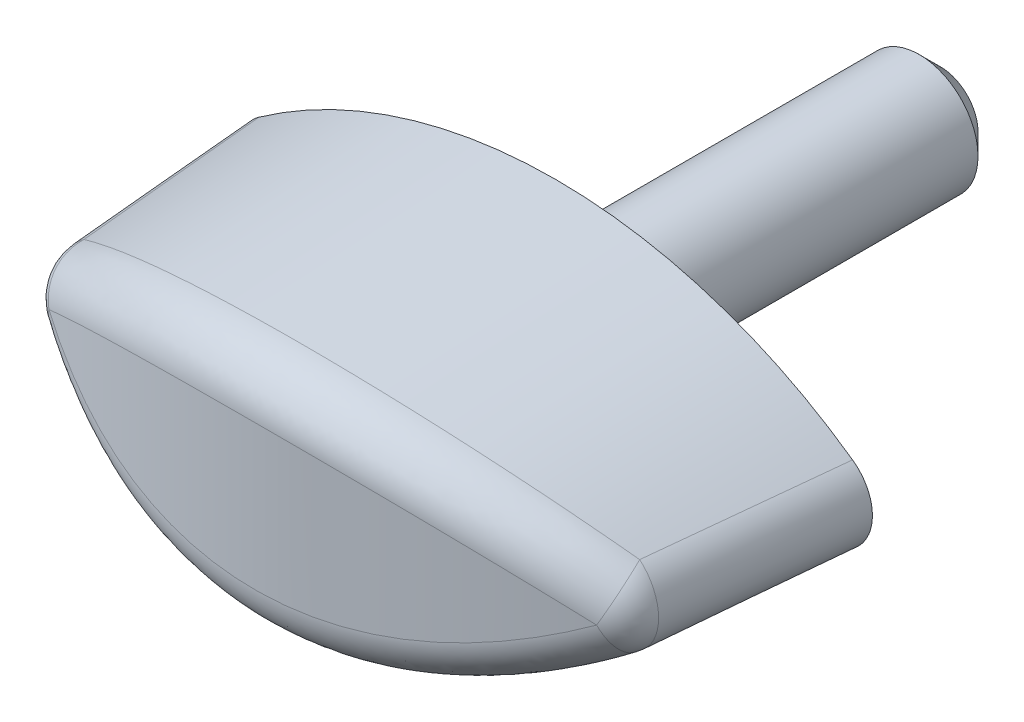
ISO-10303-21;
HEADER;
FILE_DESCRIPTION(('STEP AP214'),'2;1');
FILE_NAME('part.step','',(''),(''),'','','');
FILE_SCHEMA(('AUTOMOTIVE_DESIGN { 1 0 10303 214 1 1 1 1 }'));
ENDSEC;
DATA;
#1=APPLICATION_CONTEXT('core data for automotive mechanical design processes');
#2=APPLICATION_PROTOCOL_DEFINITION('international standard','automotive_design',2000,#1);
#3=PRODUCT_CONTEXT('',#1,'mechanical');
#4=PRODUCT('Part','Part','',(#3));
#5=PRODUCT_RELATED_PRODUCT_CATEGORY('part','',(#4));
#6=PRODUCT_DEFINITION_FORMATION('','',#4);
#7=PRODUCT_DEFINITION_CONTEXT('part definition',#1,'design');
#8=PRODUCT_DEFINITION('design','',#6,#7);
#9=PRODUCT_DEFINITION_SHAPE('','',#8);
#10=(LENGTH_UNIT() NAMED_UNIT(*) SI_UNIT(.MILLI.,.METRE.));
#11=(NAMED_UNIT(*) PLANE_ANGLE_UNIT() SI_UNIT($,.RADIAN.));
#12=(NAMED_UNIT(*) SI_UNIT($,.STERADIAN.) SOLID_ANGLE_UNIT());
#13=UNCERTAINTY_MEASURE_WITH_UNIT(LENGTH_MEASURE(1.E-05),#10,'distance_accuracy_value','');
#14=(GEOMETRIC_REPRESENTATION_CONTEXT(3) GLOBAL_UNCERTAINTY_ASSIGNED_CONTEXT((#13)) GLOBAL_UNIT_ASSIGNED_CONTEXT((#10,
#11,#12)) REPRESENTATION_CONTEXT('',''));
#15=CARTESIAN_POINT('',(0.,0.,0.));
#16=DIRECTION('',(0.,0.,1.));
#17=DIRECTION('',(1.,0.,0.));
#18=AXIS2_PLACEMENT_3D('',#15,#16,#17);
#19=CARTESIAN_POINT('',(0.0205071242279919,16.2061475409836,0.4));
#20=DIRECTION('',(0.,0.,-1.));
#21=DIRECTION('',(1.,0.,0.));
#22=AXIS2_PLACEMENT_3D('',#19,#20,#21);
#23=CONICAL_SURFACE('',#22,21.8561475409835,0.05235987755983);
#24=CARTESIAN_POINT('',(-18.0038268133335,4.22705700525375,4.48659290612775));
#25=CARTESIAN_POINT('',(-18.2353027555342,4.65339374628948,5.31089208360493));
#26=CARTESIAN_POINT('',(-17.7613775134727,5.33256348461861,5.78936527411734));
#27=CARTESIAN_POINT('',(-17.8309165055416,3.98197228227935,4.64570336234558));
#28=CARTESIAN_POINT('',(-18.0718849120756,4.41189425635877,5.4852368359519));
#29=CARTESIAN_POINT('',(-17.5900796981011,5.11052262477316,5.96231142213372));
#30=CARTESIAN_POINT('',(-17.6529331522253,3.74046857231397,4.80478797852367));
#31=CARTESIAN_POINT('',(-17.9039259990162,4.17420610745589,5.65938786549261));
#32=CARTESIAN_POINT('',(-17.4137960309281,4.89175899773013,6.13522948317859));
#33=CARTESIAN_POINT('',(-17.2867621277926,3.26461971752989,5.12219076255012));
#34=CARTESIAN_POINT('',(-17.5578873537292,3.70483151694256,6.00767494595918));
#35=CARTESIAN_POINT('',(-17.0512059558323,4.46077847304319,6.48023250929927));
#36=CARTESIAN_POINT('',(-17.0985738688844,3.03027498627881,5.28050888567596));
#37=CARTESIAN_POINT('',(-17.3796896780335,3.47312471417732,6.18185751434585));
#38=CARTESIAN_POINT('',(-16.864898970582,4.24856195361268,6.65231742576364));
#39=CARTESIAN_POINT('',(-16.5182850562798,2.33758598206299,5.75350718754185));
#40=CARTESIAN_POINT('',(-16.8272851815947,2.78403860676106,6.70551161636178));
#41=CARTESIAN_POINT('',(-16.2905405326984,3.62137007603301,7.16644601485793));
#42=CARTESIAN_POINT('',(-16.1107824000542,1.89004354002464,6.06593217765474));
#43=CARTESIAN_POINT('',(-16.4388750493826,2.33811124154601,7.05215723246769));
#44=CARTESIAN_POINT('',(-15.8873705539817,3.21626608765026,7.50603839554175));
#45=CARTESIAN_POINT('',(-15.2506273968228,1.02136727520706,6.6820586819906));
#46=CARTESIAN_POINT('',(-15.6158706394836,1.46741357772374,7.73998908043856));
#47=CARTESIAN_POINT('',(-15.0367266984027,2.43017394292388,8.17574111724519));
#48=CARTESIAN_POINT('',(-14.7975849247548,0.600522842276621,6.9856499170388));
#49=CARTESIAN_POINT('',(-15.1799412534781,1.04304672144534,8.08114848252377));
#50=CARTESIAN_POINT('',(-14.5888702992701,2.04944973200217,8.50573158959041));
#51=CARTESIAN_POINT('',(-13.8496162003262,-0.207302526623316,7.57553412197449));
#52=CARTESIAN_POINT('',(-14.2632052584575,0.222586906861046,8.74897579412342));
#53=CARTESIAN_POINT('',(-13.6521258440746,1.31882283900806,9.14691007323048));
#54=CARTESIAN_POINT('',(-13.3547095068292,-0.594299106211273,7.86183506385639));
#55=CARTESIAN_POINT('',(-13.7814750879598,-0.173189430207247,9.07552834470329));
#56=CARTESIAN_POINT('',(-13.1632569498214,0.968905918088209,9.45810674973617));
#57=CARTESIAN_POINT('',(-12.4154912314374,-1.2649904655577,8.36262386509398));
#58=CARTESIAN_POINT('',(-12.8628690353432,-0.863893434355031,9.65087838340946));
#59=CARTESIAN_POINT('',(-12.2358294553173,0.362618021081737,10.0024424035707));
#60=CARTESIAN_POINT('',(-11.977947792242,-1.55478558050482,8.58080079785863));
#61=CARTESIAN_POINT('',(-12.4317248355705,-1.16470696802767,9.90362925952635));
#62=CARTESIAN_POINT('',(-11.8038970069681,0.100705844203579,10.2395912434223));
#63=CARTESIAN_POINT('',(-11.0753093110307,-2.10663619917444,8.99881304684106));
#64=CARTESIAN_POINT('',(-11.5367851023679,-1.74202458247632,10.3917956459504));
#65=CARTESIAN_POINT('',(-10.9130691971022,-0.397959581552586,10.6939523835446));
#66=CARTESIAN_POINT('',(-10.6102130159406,-2.36869043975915,9.19864752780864));
#67=CARTESIAN_POINT('',(-11.0727134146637,-2.01804329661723,10.6268478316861));
#68=CARTESIAN_POINT('',(-10.4541726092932,-0.634711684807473,10.9111637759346));
#69=CARTESIAN_POINT('',(-9.65567222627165,-2.86110840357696,9.57594927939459));
#70=CARTESIAN_POINT('',(-10.1137074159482,-2.54109592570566,11.0745123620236));
#71=CARTESIAN_POINT('',(-9.51257653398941,-1.07951502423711,11.321274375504));
#72=CARTESIAN_POINT('',(-9.16633777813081,-3.09160016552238,9.75350665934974));
#73=CARTESIAN_POINT('',(-9.61883722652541,-2.78764164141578,11.2867302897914));
#74=CARTESIAN_POINT('',(-9.02998470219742,-1.28768223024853,11.5142715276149));
#75=CARTESIAN_POINT('',(-8.16345693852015,-3.51905367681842,10.083986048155));
#76=CARTESIAN_POINT('',(-8.59712149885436,-3.24891920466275,11.6853145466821));
#77=CARTESIAN_POINT('',(-8.0411221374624,-1.67368210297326,11.8734882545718));
#78=CARTESIAN_POINT('',(-7.64991829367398,-3.71602606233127,10.2369158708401));
#79=CARTESIAN_POINT('',(-8.07055146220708,-3.46292630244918,11.8710758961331));
#80=CARTESIAN_POINT('',(-7.53485898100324,-1.85152439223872,12.0397163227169));
#81=CARTESIAN_POINT('',(-6.7694810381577,-4.01605406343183,10.4704600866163));
#82=CARTESIAN_POINT('',(-7.16268794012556,-3.79115647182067,12.1567837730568));
#83=CARTESIAN_POINT('',(-6.6670401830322,-2.12238362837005,12.2935687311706));
#84=CARTESIAN_POINT('',(-6.40832988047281,-4.12897787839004,10.558543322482));
#85=CARTESIAN_POINT('',(-6.78801248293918,-3.91548565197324,12.2652515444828));
#86=CARTESIAN_POINT('',(-6.31110410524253,-2.22431992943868,12.3893113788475));
#87=CARTESIAN_POINT('',(-5.67723295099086,-4.3369742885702,10.7210016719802));
#88=CARTESIAN_POINT('',(-6.02590993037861,-4.14574032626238,12.4664300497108));
#89=CARTESIAN_POINT('',(-5.59063350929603,-2.41206608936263,12.565896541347));
#90=CARTESIAN_POINT('',(-5.30728847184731,-4.43204948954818,10.7953787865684));
#91=CARTESIAN_POINT('',(-5.6387889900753,-4.251416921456,12.5589255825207));
#92=CARTESIAN_POINT('',(-5.22610025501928,-2.49787830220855,12.6467412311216));
#93=CARTESIAN_POINT('',(-4.55952281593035,-4.6035681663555,10.9296651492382));
#94=CARTESIAN_POINT('',(-4.85286893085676,-4.44301053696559,12.7267824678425));
#95=CARTESIAN_POINT('',(-4.48933037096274,-2.65267833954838,12.792704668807));
#96=CARTESIAN_POINT('',(-4.18169422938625,-4.67999317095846,10.9895600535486));
#97=CARTESIAN_POINT('',(-4.45446541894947,-4.52867029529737,12.8019196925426));
#98=CARTESIAN_POINT('',(-4.1170864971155,-2.72164948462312,12.8578078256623));
#99=CARTESIAN_POINT('',(-3.42013759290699,-4.81332033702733,11.0940646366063));
#100=CARTESIAN_POINT('',(-3.64837479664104,-4.67874759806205,12.9336037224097));
#101=CARTESIAN_POINT('',(-3.36683228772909,-2.84196864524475,12.9713997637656));
#102=CARTESIAN_POINT('',(-3.03641081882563,-4.87022666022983,11.1386775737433));
#103=CARTESIAN_POINT('',(-3.2411868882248,-4.74296506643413,12.9899751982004));
#104=CARTESIAN_POINT('',(-2.98882319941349,-2.89332041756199,13.0198920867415));
#105=CARTESIAN_POINT('',(-2.1671306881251,-4.97577324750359,11.221343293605));
#106=CARTESIAN_POINT('',(-2.31554824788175,-4.86253023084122,13.0948581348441));
#107=CARTESIAN_POINT('',(-2.13253230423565,-2.98856296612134,13.1097461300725));
#108=CARTESIAN_POINT('',(-1.68033545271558,-5.01869644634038,11.2548939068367));
#109=CARTESIAN_POINT('',(-1.79649974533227,-4.91120460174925,13.1374926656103));
#110=CARTESIAN_POINT('',(-1.65303636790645,-3.0272942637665,13.1462141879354));
#111=CARTESIAN_POINT('',(-0.703597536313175,-5.07224437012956,11.2964539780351));
#112=CARTESIAN_POINT('',(-0.752362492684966,-4.97208339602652,13.1904952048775));
#113=CARTESIAN_POINT('',(-0.690967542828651,-3.07561380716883,13.1913881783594));
#114=CARTESIAN_POINT('',(-0.213654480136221,-5.08286517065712,11.3044603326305));
#115=CARTESIAN_POINT('',(-0.228537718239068,-4.98413547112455,13.2007294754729));
#116=CARTESIAN_POINT('',(-0.208394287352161,-3.08519851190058,13.2000907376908));
#117=CARTESIAN_POINT('',(0.76534404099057,-5.07162294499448,11.2947594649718));
#118=CARTESIAN_POINT('',(0.819143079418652,-4.97124902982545,13.1884364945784));
#119=CARTESIAN_POINT('',(0.755883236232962,-3.07505889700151,13.1895463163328));
#120=CARTESIAN_POINT('',(1.25439979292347,-5.04977360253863,11.2770630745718));
#121=CARTESIAN_POINT('',(1.34170296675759,-4.9463585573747,13.1659528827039));
#122=CARTESIAN_POINT('',(1.23758778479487,-3.05534692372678,13.1703111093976));
#123=CARTESIAN_POINT('',(2.22804789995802,-4.97400743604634,11.2163362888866));
#124=CARTESIAN_POINT('',(2.38127784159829,-4.86015346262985,13.0887957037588));
#125=CARTESIAN_POINT('',(2.19663390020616,-2.98698692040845,13.1043037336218));
#126=CARTESIAN_POINT('',(2.71264037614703,-4.92009148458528,11.1733065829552));
#127=CARTESIAN_POINT('',(2.89706684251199,-4.79904737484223,13.0343075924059));
#128=CARTESIAN_POINT('',(2.67397558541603,-2.93833967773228,13.0575323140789));
#129=CARTESIAN_POINT('',(3.67200218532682,-4.78138724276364,11.0629851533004));
#130=CARTESIAN_POINT('',(3.91584585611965,-4.6422264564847,12.8949207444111));
#131=CARTESIAN_POINT('',(3.61904260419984,-2.8131810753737,12.9376177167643));
#132=CARTESIAN_POINT('',(4.14680204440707,-4.69671804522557,10.9957870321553));
#133=CARTESIAN_POINT('',(4.41780959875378,-4.54699536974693,12.8104488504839));
#134=CARTESIAN_POINT('',(4.0867977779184,-2.73677720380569,12.8645762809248));
#135=CARTESIAN_POINT('',(5.08537461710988,-4.497833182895,10.838369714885));
#136=CARTESIAN_POINT('',(5.40650453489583,-4.32414460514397,12.6133155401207));
#137=CARTESIAN_POINT('',(5.01152803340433,-2.55729221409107,12.6934705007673));
#138=CARTESIAN_POINT('',(5.54914718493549,-4.38361712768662,10.7481502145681));
#139=CARTESIAN_POINT('',(5.89239386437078,-4.19696843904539,12.5010431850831));
#140=CARTESIAN_POINT('',(5.46850297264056,-2.45421074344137,12.5954058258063));
#141=CARTESIAN_POINT('',(6.46422741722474,-4.12696970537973,10.5460047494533));
#142=CARTESIAN_POINT('',(6.84671164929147,-3.91258104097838,12.250728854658));
#143=CARTESIAN_POINT('',(6.3702753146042,-2.22255962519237,12.3756824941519));
#144=CARTESIAN_POINT('',(6.91549919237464,-3.98446510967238,10.4340224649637));
#145=CARTESIAN_POINT('',(7.31449395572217,-3.75578034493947,12.1130441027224));
#146=CARTESIAN_POINT('',(6.81503762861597,-2.09392382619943,12.2539626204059));
#147=CARTESIAN_POINT('',(7.80222867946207,-3.67328564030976,10.1902987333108));
#148=CARTESIAN_POINT('',(8.22884581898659,-3.41528661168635,11.8150947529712));
#149=CARTESIAN_POINT('',(7.68909926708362,-1.81299559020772,11.9890455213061));
#150=CARTESIAN_POINT('',(8.23768325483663,-3.50460561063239,10.0585533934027));
#151=CARTESIAN_POINT('',(8.67503745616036,-3.23207843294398,11.6552450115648));
#152=CARTESIAN_POINT('',(8.11839552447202,-1.6606984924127,11.8458440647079));
#153=CARTESIAN_POINT('',(9.21552461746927,-3.09028606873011,9.73620035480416));
#154=CARTESIAN_POINT('',(9.66984109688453,-2.78545908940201,11.2671467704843));
#155=CARTESIAN_POINT('',(9.08256592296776,-1.28656922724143,11.4954603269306));
#156=CARTESIAN_POINT('',(9.75208497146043,-2.83654535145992,9.53962844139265));
#157=CARTESIAN_POINT('',(10.2121675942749,-2.51416550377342,11.03245380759));
#158=CARTESIAN_POINT('',(9.61174206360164,-1.05740804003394,11.2817952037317));
#159=CARTESIAN_POINT('',(10.7938246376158,-2.29258034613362,9.12085376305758));
#160=CARTESIAN_POINT('',(11.257595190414,-1.93695755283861,10.5364024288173));
#161=CARTESIAN_POINT('',(10.6393970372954,-0.566038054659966,10.8266053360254));
#162=CARTESIAN_POINT('',(11.2989828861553,-2.0023319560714,8.89863407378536));
#163=CARTESIAN_POINT('',(11.7607660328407,-1.63182132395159,10.2756679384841));
#164=CARTESIAN_POINT('',(11.1378552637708,-0.303807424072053,10.5850621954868));
#165=CARTESIAN_POINT('',(12.2732395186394,-1.39107898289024,8.43424130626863));
#166=CARTESIAN_POINT('',(12.724624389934,-0.993840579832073,9.73490830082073));
#167=CARTESIAN_POINT('',(12.0994567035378,0.248562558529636,10.080287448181));
#168=CARTESIAN_POINT('',(12.7425367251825,-1.07027012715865,8.19219643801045));
#169=CARTESIAN_POINT('',(13.1859003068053,-0.661794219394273,9.45547043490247));
#170=CARTESIAN_POINT('',(12.5627944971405,0.538524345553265,9.81719520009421));
#171=CARTESIAN_POINT('',(13.6471688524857,-0.399988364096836,7.69133618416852));
#172=CARTESIAN_POINT('',(14.0693072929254,0.027161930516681,8.88149183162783));
#173=CARTESIAN_POINT('',(13.4562091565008,1.14449761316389,9.27278188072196));
#174=CARTESIAN_POINT('',(14.0825554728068,-0.0505608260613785,7.43254747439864));
#175=CARTESIAN_POINT('',(14.4920609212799,0.3836279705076,8.58722665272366));
#176=CARTESIAN_POINT('',(13.8863366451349,1.460467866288,8.99148980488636));
#177=CARTESIAN_POINT('',(14.5010970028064,0.311908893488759,7.16716554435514));
#178=CARTESIAN_POINT('',(14.8995108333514,0.754135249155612,8.28496191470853));
#179=CARTESIAN_POINT('',(14.2999615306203,1.78831375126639,8.70303118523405));
#180=(BOUNDED_SURFACE() B_SPLINE_SURFACE(3,2,((#24,#25,#26),(#27,#28,#29),(#30,#31,#32),(#33,
#34,#35),(#36,#37,#38),(#39,#40,#41),(#42,#43,#44),(#45,#46,#47),(#48,#49,#50),(#51,#52,#53),
(#54,#55,#56),(#57,#58,#59),(#60,#61,#62),(#63,#64,#65),(#66,#67,#68),(#69,#70,#71),(#72,#73,
#74),(#75,#76,#77),(#78,#79,#80),(#81,#82,#83),(#84,#85,#86),(#87,#88,#89),(#90,#91,#92),(#93,
#94,#95),(#96,#97,#98),(#99,#100,#101),(#102,#103,#104),(#105,#106,#107),(#108,#109,#110),(#111,
#112,#113),(#114,#115,#116),(#117,#118,#119),(#120,#121,#122),(#123,#124,#125),(#126,#127,#128),
(#129,#130,#131),(#132,#133,#134),(#135,#136,#137),(#138,#139,#140),(#141,#142,#143),(#144,#145,
#146),(#147,#148,#149),(#150,#151,#152),(#153,#154,#155),(#156,#157,#158),(#159,#160,#161),
(#162,#163,#164),(#165,#166,#167),(#168,#169,#170),(#171,#172,#173),(#174,#175,#176),(#177,#178,
#179)),.UNSPECIFIED.,.F.,.F.,.F.) B_SPLINE_SURFACE_WITH_KNOTS((4,2,2,2,2,2,2,2,2,2,2,2,2,2,2,2,
2,2,2,2,2,2,2,2,2,4),(3,3),(0.,0.945982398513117,1.89201934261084,3.78585558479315,
5.69758106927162,7.60841828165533,9.1777088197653,10.7470707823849,12.3098647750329,
13.8721619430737,14.9337876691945,15.9952582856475,17.0577759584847,18.1200669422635,
19.4506366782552,20.7813680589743,22.111538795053,23.4416733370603,24.7667108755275,
26.0917659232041,27.4202968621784,28.7490898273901,30.4651863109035,32.1824217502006,
33.8893166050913,35.5935560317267),(0.,1.),
.UNSPECIFIED.) GEOMETRIC_REPRESENTATION_ITEM() RATIONAL_B_SPLINE_SURFACE(((1.,0.902145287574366,
1.),(1.,0.899158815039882,1.),(1.,0.896106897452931,1.),(1.,0.889883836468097,1.),(1.,
0.88671268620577,1.),(1.,0.877032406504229,1.),(1.,0.8703620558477,1.),(1.,0.856652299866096,
1.),(1.,0.849610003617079,1.),(1.,0.835377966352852,1.),(1.,0.828188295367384,1.),(1.,
0.815146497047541,1.),(1.,0.809284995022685,1.),(1.,0.797739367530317,1.),(1.,0.792055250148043,
1.),(1.,0.7810508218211,1.),(1.,0.775729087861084,1.),(1.,0.765604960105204,1.),(1.,
0.760802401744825,1.),(1.,0.7533331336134,1.),(1.,0.750475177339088,1.),(1.,0.745146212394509,
1.),(1.,0.742675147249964,1.),(1.,0.738173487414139,1.),(1.,0.736143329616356,1.),(1.,
0.732576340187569,1.),(1.,0.731039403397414,1.),(1.,0.728177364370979,1.),(1.,0.727003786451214,
1.),(1.,0.725543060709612,1.),(1.,0.725256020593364,1.),(1.,0.72558081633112,1.),(1.,
0.726192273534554,1.),(1.,0.728287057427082,1.),(1.,0.729770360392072,1.),(1.,0.733539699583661,
1.),(1.,0.73582263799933,1.),(1.,0.741103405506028,1.),(1.,0.744101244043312,1.),(1.,
0.750713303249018,1.),(1.,0.754329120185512,1.),(1.,0.762055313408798,1.),(1.,0.766165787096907,
1.),(1.,0.776017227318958,1.),(1.,0.781884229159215,1.),(1.,0.794011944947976,1.),(1.,
0.800272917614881,1.),(1.,0.812936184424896,1.),(1.,0.819337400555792,1.),(1.,0.832141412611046,
1.),(1.,0.83854419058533,1.),(1.,0.8448701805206,1.))) REPRESENTATION_ITEM('') SURFACE());
#181=CARTESIAN_POINT('',(14.5010970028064,0.311908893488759,7.16716554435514));
#182=CARTESIAN_POINT('',(14.0825554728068,-0.050560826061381,7.43254747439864));
#183=CARTESIAN_POINT('',(13.6471688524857,-0.399988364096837,7.69133618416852));
#184=CARTESIAN_POINT('',(12.7425367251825,-1.07027012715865,8.19219643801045));
#185=CARTESIAN_POINT('',(12.2732395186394,-1.39107898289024,8.43424130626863));
#186=CARTESIAN_POINT('',(11.2989828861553,-2.0023319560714,8.89863407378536));
#187=CARTESIAN_POINT('',(10.7938246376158,-2.29258034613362,9.12085376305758));
#188=CARTESIAN_POINT('',(9.75208497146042,-2.83654535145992,9.53962844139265));
#189=CARTESIAN_POINT('',(9.21552461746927,-3.09028606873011,9.73620035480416));
#190=CARTESIAN_POINT('',(8.23768325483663,-3.50460561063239,10.0585533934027));
#191=CARTESIAN_POINT('',(7.80222867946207,-3.67328564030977,10.1902987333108));
#192=CARTESIAN_POINT('',(6.91549919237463,-3.98446510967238,10.4340224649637));
#193=CARTESIAN_POINT('',(6.46422741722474,-4.12696970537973,10.5460047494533));
#194=CARTESIAN_POINT('',(5.54914718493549,-4.38361712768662,10.7481502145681));
#195=CARTESIAN_POINT('',(5.08537461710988,-4.497833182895,10.838369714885));
#196=CARTESIAN_POINT('',(4.14680204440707,-4.69671804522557,10.9957870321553));
#197=CARTESIAN_POINT('',(3.67200218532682,-4.78138724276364,11.0629851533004));
#198=CARTESIAN_POINT('',(2.71264037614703,-4.92009148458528,11.1733065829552));
#199=CARTESIAN_POINT('',(2.22804789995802,-4.97400743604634,11.2163362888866));
#200=CARTESIAN_POINT('',(1.25439979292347,-5.04977360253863,11.2770630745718));
#201=CARTESIAN_POINT('',(0.765344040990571,-5.07162294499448,11.2947594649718));
#202=CARTESIAN_POINT('',(-0.21365448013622,-5.08286517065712,11.3044603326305));
#203=CARTESIAN_POINT('',(-0.703597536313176,-5.07224437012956,11.2964539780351));
#204=CARTESIAN_POINT('',(-1.68033545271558,-5.01869644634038,11.2548939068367));
#205=CARTESIAN_POINT('',(-2.1671306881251,-4.97577324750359,11.221343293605));
#206=CARTESIAN_POINT('',(-3.03641081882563,-4.87022666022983,11.1386775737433));
#207=CARTESIAN_POINT('',(-3.42013759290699,-4.81332033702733,11.0940646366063));
#208=CARTESIAN_POINT('',(-4.18169422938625,-4.67999317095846,10.9895600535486));
#209=CARTESIAN_POINT('',(-4.55952281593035,-4.6035681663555,10.9296651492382));
#210=CARTESIAN_POINT('',(-5.30728847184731,-4.43204948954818,10.7953787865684));
#211=CARTESIAN_POINT('',(-5.67723295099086,-4.3369742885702,10.7210016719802));
#212=CARTESIAN_POINT('',(-6.40832988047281,-4.12897787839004,10.558543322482));
#213=CARTESIAN_POINT('',(-6.7694810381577,-4.01605406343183,10.4704600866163));
#214=CARTESIAN_POINT('',(-7.64991829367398,-3.71602606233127,10.2369158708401));
#215=CARTESIAN_POINT('',(-8.16345693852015,-3.51905367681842,10.083986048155));
#216=CARTESIAN_POINT('',(-9.16633777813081,-3.09160016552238,9.75350665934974));
#217=CARTESIAN_POINT('',(-9.65567222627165,-2.86110840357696,9.57594927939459));
#218=CARTESIAN_POINT('',(-10.6102130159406,-2.36869043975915,9.19864752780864));
#219=CARTESIAN_POINT('',(-11.0753093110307,-2.10663619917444,8.99881304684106));
#220=CARTESIAN_POINT('',(-11.977947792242,-1.55478558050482,8.58080079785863));
#221=CARTESIAN_POINT('',(-12.4154912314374,-1.2649904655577,8.36262386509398));
#222=CARTESIAN_POINT('',(-13.3547095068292,-0.594299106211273,7.86183506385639));
#223=CARTESIAN_POINT('',(-13.8496162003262,-0.207302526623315,7.57553412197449));
#224=CARTESIAN_POINT('',(-14.7975849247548,0.600522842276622,6.9856499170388));
#225=CARTESIAN_POINT('',(-15.2506273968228,1.02136727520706,6.6820586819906));
#226=CARTESIAN_POINT('',(-16.1107824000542,1.89004354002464,6.06593217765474));
#227=CARTESIAN_POINT('',(-16.5182850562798,2.33758598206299,5.75350718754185));
#228=CARTESIAN_POINT('',(-17.0985738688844,3.03027498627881,5.28050888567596));
#229=CARTESIAN_POINT('',(-17.2867621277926,3.26461971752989,5.12219076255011));
#230=CARTESIAN_POINT('',(-17.6529331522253,3.74046857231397,4.80478797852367));
#231=CARTESIAN_POINT('',(-17.8309165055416,3.98197228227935,4.64570336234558));
#232=CARTESIAN_POINT('',(-18.0038268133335,4.22705700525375,4.48659290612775));
#233=B_SPLINE_CURVE_WITH_KNOTS('',3,(#181,#182,#183,#184,#185,#186,#187,#188,#189,#190,#191,
#192,#193,#194,#195,#196,#197,#198,#199,#200,#201,#202,#203,#204,#205,#206,#207,#208,#209,#210,
#211,#212,#213,#214,#215,#216,#217,#218,#219,#220,#221,#222,#223,#224,#225,#226,#227,#228,#229,
#230,#231,#232),.UNSPECIFIED.,.F.,.F.,(4,2,2,2,2,2,2,2,2,2,2,2,2,2,2,2,2,2,2,2,2,2,2,2,2,4),(0.,
1.70423942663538,3.41113428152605,5.12836972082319,6.84446620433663,8.17325916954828,
9.5017901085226,10.8268451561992,12.1518826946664,13.4820172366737,14.8121879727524,
16.1429193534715,17.4734890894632,18.535780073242,19.5982977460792,20.6597683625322,
21.721394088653,23.2836912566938,24.8464852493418,26.4158472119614,27.9851377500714,
29.8959749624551,31.8077004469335,33.7015366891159,34.6475736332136,35.5935560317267),.UNSPECIFIED.);
#234=CARTESIAN_POINT('',(11.83469785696,-1.666138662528,8.64322073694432));
#235=VERTEX_POINT('',#234);
#236=CARTESIAN_POINT('',(-11.7914264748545,-1.66623828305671,8.66538325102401));
#237=VERTEX_POINT('',#236);
#238=EDGE_CURVE('E83',#235,#237,#233,.T.);
#239=ORIENTED_EDGE('',*,*,#238,.T.);
#240=CARTESIAN_POINT('',(-7.89432788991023,1.828889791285,41.6302924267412));
#241=CARTESIAN_POINT('',(-9.07491009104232,1.30196925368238,41.7842546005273));
#242=CARTESIAN_POINT('',(-9.07491009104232,0.,41.7842546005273));
#243=CARTESIAN_POINT('',(-9.07491009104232,-1.30196925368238,41.7842546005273));
#244=CARTESIAN_POINT('',(-7.89432788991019,-1.82888979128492,41.6302924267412));
#245=CARTESIAN_POINT('',(-8.00444444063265,1.82471175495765,40.858828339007));
#246=CARTESIAN_POINT('',(-9.17573478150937,1.29463326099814,41.0110620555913));
#247=CARTESIAN_POINT('',(-9.17590065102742,0.,41.0097764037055));
#248=CARTESIAN_POINT('',(-9.17573478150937,-1.29463326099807,41.0110620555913));
#249=CARTESIAN_POINT('',(-8.00444444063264,-1.82471175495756,40.858828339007));
#250=CARTESIAN_POINT('',(-8.11256094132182,1.82056113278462,40.0871396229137));
#251=CARTESIAN_POINT('',(-9.27496878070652,1.28749542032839,40.2364778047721));
#252=CARTESIAN_POINT('',(-9.27512225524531,0.,40.2352570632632));
#253=CARTESIAN_POINT('',(-9.27496878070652,-1.2874954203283,40.2364778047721));
#254=CARTESIAN_POINT('',(-8.11256094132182,-1.82056113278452,40.0871396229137));
#255=CARTESIAN_POINT('',(-8.32519277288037,1.81231396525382,38.5433707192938));
#256=CARTESIAN_POINT('',(-9.47023376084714,1.27360234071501,38.6873613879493));
#257=CARTESIAN_POINT('',(-9.47038826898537,0.,38.6861387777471));
#258=CARTESIAN_POINT('',(-9.47023376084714,-1.27360234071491,38.6873613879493));
#259=CARTESIAN_POINT('',(-8.32519277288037,-1.81231396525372,38.5433707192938));
#260=CARTESIAN_POINT('',(-8.42970811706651,1.80821741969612,37.7712905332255));
#261=CARTESIAN_POINT('',(-9.56629226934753,1.26684465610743,37.9126906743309));
#262=CARTESIAN_POINT('',(-9.56643269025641,0.,37.9115398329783));
#263=CARTESIAN_POINT('',(-9.56629226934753,-1.26684465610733,37.9126906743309));
#264=CARTESIAN_POINT('',(-8.42970811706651,-1.80821741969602,37.7712905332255));
#265=CARTESIAN_POINT('',(-8.73844851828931,1.79600786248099,35.4545670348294));
#266=CARTESIAN_POINT('',(-9.84977771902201,1.24711207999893,35.5922379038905));
#267=CARTESIAN_POINT('',(-9.85033914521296,0.,35.5876452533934));
#268=CARTESIAN_POINT('',(-9.84977771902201,-1.24711207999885,35.5922379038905));
#269=CARTESIAN_POINT('',(-8.73844851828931,-1.7960078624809,35.4545670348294));
#270=CARTESIAN_POINT('',(-8.93787164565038,1.78797478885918,33.9094146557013));
#271=CARTESIAN_POINT('',(-10.0334998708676,1.23460657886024,34.0423578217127));
#272=CARTESIAN_POINT('',(-10.033977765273,0.,34.0382256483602));
#273=CARTESIAN_POINT('',(-10.0334998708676,-1.23460657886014,34.0423578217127));
#274=CARTESIAN_POINT('',(-8.93787164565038,-1.78797478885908,33.9094146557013));
#275=CARTESIAN_POINT('',(-9.32624975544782,1.77211564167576,30.8181498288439));
#276=CARTESIAN_POINT('',(-10.391617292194,1.21071439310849,30.943271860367));
#277=CARTESIAN_POINT('',(-10.3920912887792,0.,30.9391665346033));
#278=CARTESIAN_POINT('',(-10.391617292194,-1.21071439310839,30.943271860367));
#279=CARTESIAN_POINT('',(-9.32624975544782,-1.77211564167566,30.8181498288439));
#280=CARTESIAN_POINT('',(-9.51520528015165,1.76428955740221,29.2720374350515));
#281=CARTESIAN_POINT('',(-10.5661548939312,1.19931556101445,29.3932616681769));
#282=CARTESIAN_POINT('',(-10.5665666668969,0.,29.3895270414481));
#283=CARTESIAN_POINT('',(-10.5661548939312,-1.19931556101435,29.3932616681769));
#284=CARTESIAN_POINT('',(-9.51520528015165,-1.76428955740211,29.2720374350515));
#285=CARTESIAN_POINT('',(-9.88435650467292,1.74883709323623,26.1789744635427));
#286=CARTESIAN_POINT('',(-10.907471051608,1.17745228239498,26.2936723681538));
#287=CARTESIAN_POINT('',(-10.9078785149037,0.,26.2899672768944));
#288=CARTESIAN_POINT('',(-10.907471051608,-1.17745228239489,26.2936723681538));
#289=CARTESIAN_POINT('',(-9.88435650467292,-1.74883709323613,26.1789744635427));
#290=CARTESIAN_POINT('',(-10.064552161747,1.74121071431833,24.6320238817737));
#291=CARTESIAN_POINT('',(-11.0743604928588,1.16697864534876,24.7434205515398));
#292=CARTESIAN_POINT('',(-11.0747149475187,0.,24.7400470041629));
#293=CARTESIAN_POINT('',(-11.0743604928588,-1.16697864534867,24.7434205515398));
#294=CARTESIAN_POINT('',(-10.064552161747,-1.74121071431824,24.6320238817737));
#295=CARTESIAN_POINT('',(-10.5939877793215,1.71862284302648,19.9905638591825));
#296=CARTESIAN_POINT('',(-11.5641004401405,1.13681088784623,20.1038344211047));
#297=CARTESIAN_POINT('',(-11.5655307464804,0.,20.0903155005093));
#298=CARTESIAN_POINT('',(-11.5641004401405,-1.13681088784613,20.1038344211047));
#299=CARTESIAN_POINT('',(-10.5939877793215,-1.71862284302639,19.9905638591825));
#300=CARTESIAN_POINT('',(-10.9321260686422,1.70395056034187,16.8950446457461));
#301=CARTESIAN_POINT('',(-11.8787301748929,1.11819309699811,17.001617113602));
#302=CARTESIAN_POINT('',(-11.8798624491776,0.,16.990131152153));
#303=CARTESIAN_POINT('',(-11.8787301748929,-1.11819309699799,17.001617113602));
#304=CARTESIAN_POINT('',(-10.9321260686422,-1.70395056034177,16.8950446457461));
#305=CARTESIAN_POINT('',(-11.586188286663,1.67532423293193,10.7020989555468));
#306=CARTESIAN_POINT('',(-12.4882121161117,1.08334156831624,10.8002633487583));
#307=CARTESIAN_POINT('',(-12.4893228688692,0.,10.7889269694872));
#308=CARTESIAN_POINT('',(-12.4882121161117,-1.08334156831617,10.8002633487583));
#309=CARTESIAN_POINT('',(-11.586188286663,-1.67532423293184,10.7020989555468));
#310=CARTESIAN_POINT('',(-11.9021118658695,1.6613701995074,7.60467244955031));
#311=CARTESIAN_POINT('',(-12.7835395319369,1.06707151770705,7.69773687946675));
#312=CARTESIAN_POINT('',(-12.7844512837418,0.,7.68790712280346));
#313=CARTESIAN_POINT('',(-12.7835395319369,-1.06707151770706,7.69773687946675));
#314=CARTESIAN_POINT('',(-11.9021118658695,-1.66137019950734,7.60467244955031));
#315=CARTESIAN_POINT('',(-12.5164591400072,1.63413268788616,1.40879557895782));
#316=CARTESIAN_POINT('',(-13.3587286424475,1.03639845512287,1.49534210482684));
#317=CARTESIAN_POINT('',(-13.3596338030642,0.,1.48557968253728));
#318=CARTESIAN_POINT('',(-13.3587286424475,-1.03639845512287,1.49534210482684));
#319=CARTESIAN_POINT('',(-12.5164591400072,-1.63413268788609,1.40879557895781));
#320=CARTESIAN_POINT('',(-12.8148848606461,1.62084913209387,-1.68965462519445));
#321=CARTESIAN_POINT('',(-13.6389325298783,1.02197053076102,-1.60716683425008));
#322=CARTESIAN_POINT('',(-13.6396896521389,0.,-1.61572783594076));
#323=CARTESIAN_POINT('',(-13.6389325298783,-1.02197053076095,-1.60716683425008));
#324=CARTESIAN_POINT('',(-12.8148848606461,-1.62084913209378,-1.68965462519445));
#325=CARTESIAN_POINT('',(-13.3976407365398,1.59490528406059,-7.88759740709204));
#326=CARTESIAN_POINT('',(-14.1869478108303,0.994615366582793,-7.8103683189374));
#327=CARTESIAN_POINT('',(-14.1876971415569,0.,-7.81885945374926));
#328=CARTESIAN_POINT('',(-14.1869478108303,-0.99461536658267,-7.8103683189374));
#329=CARTESIAN_POINT('',(-13.3976407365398,-1.59490528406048,-7.88759740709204));
#330=CARTESIAN_POINT('',(-13.6819709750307,1.58224498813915,-10.9870899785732));
#331=CARTESIAN_POINT('',(-14.4550130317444,0.981670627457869,-10.913176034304));
#332=CARTESIAN_POINT('',(-14.4556488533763,0.,-10.9206835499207));
#333=CARTESIAN_POINT('',(-14.4550130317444,-0.981670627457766,-10.913176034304));
#334=CARTESIAN_POINT('',(-13.6819709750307,-1.58224498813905,-10.9870899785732));
#335=CARTESIAN_POINT('',(-14.2390516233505,1.55750384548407,-17.1873012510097));
#336=CARTESIAN_POINT('',(-14.9809971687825,0.957013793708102,-17.1176658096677));
#337=CARTESIAN_POINT('',(-14.9816338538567,0.,-17.1251687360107));
#338=CARTESIAN_POINT('',(-14.9809971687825,-0.957013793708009,-17.1176658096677));
#339=CARTESIAN_POINT('',(-14.2390516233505,-1.55750384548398,-17.1873012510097));
#340=CARTESIAN_POINT('',(-14.5118005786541,1.54542307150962,-20.2880200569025));
#341=CARTESIAN_POINT('',(-15.2391098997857,0.945289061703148,-20.2210778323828));
#342=CARTESIAN_POINT('',(-15.2396658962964,0.,-20.2278298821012));
#343=CARTESIAN_POINT('',(-15.2391098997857,-0.945289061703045,-20.2210778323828));
#344=CARTESIAN_POINT('',(-14.5118005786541,-1.54542307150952,-20.2880200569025));
#345=CARTESIAN_POINT('',(-15.0474526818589,1.52180477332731,-26.4901509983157));
#346=CARTESIAN_POINT('',(-15.7467723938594,0.922880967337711,-26.4269663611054));
#347=CARTESIAN_POINT('',(-15.7473066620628,0.,-26.4335421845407));
#348=CARTESIAN_POINT('',(-15.7467723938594,-0.922880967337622,-26.4269663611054));
#349=CARTESIAN_POINT('',(-15.0474526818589,-1.52180477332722,-26.4901509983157));
#350=CARTESIAN_POINT('',(-15.3103558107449,1.51026725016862,-29.5915631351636));
#351=CARTESIAN_POINT('',(-15.9964770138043,0.912187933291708,-29.5308923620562));
#352=CARTESIAN_POINT('',(-15.9969153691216,0.,-29.5365933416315));
#353=CARTESIAN_POINT('',(-15.9964770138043,-0.912187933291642,-29.5308923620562));
#354=CARTESIAN_POINT('',(-15.3103558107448,-1.51026725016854,-29.5915631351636));
#355=CARTESIAN_POINT('',(-15.569221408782,1.49898242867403,-32.6932435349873));
#356=CARTESIAN_POINT('',(-16.243077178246,0.901907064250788,-32.6398041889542));
#357=CARTESIAN_POINT('',(-16.243077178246,0.,-32.6398041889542));
#358=CARTESIAN_POINT('',(-16.243077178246,-0.901907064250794,-32.6398041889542));
#359=CARTESIAN_POINT('',(-15.569221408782,-1.49898242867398,-32.6932435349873));
#360=(BOUNDED_SURFACE() B_SPLINE_SURFACE(3,2,((#240,#241,#242,#243,#244),(#245,#246,#247,#248,
#249),(#250,#251,#252,#253,#254),(#255,#256,#257,#258,#259),(#260,#261,#262,#263,#264),(#265,
#266,#267,#268,#269),(#270,#271,#272,#273,#274),(#275,#276,#277,#278,#279),(#280,#281,#282,#283,
#284),(#285,#286,#287,#288,#289),(#290,#291,#292,#293,#294),(#295,#296,#297,#298,#299),(#300,
#301,#302,#303,#304),(#305,#306,#307,#308,#309),(#310,#311,#312,#313,#314),(#315,#316,#317,#318,
#319),(#320,#321,#322,#323,#324),(#325,#326,#327,#328,#329),(#330,#331,#332,#333,#334),(#335,
#336,#337,#338,#339),(#340,#341,#342,#343,#344),(#345,#346,#347,#348,#349),(#350,#351,#352,#353,
#354),(#355,#356,#357,#358,#359)),.UNSPECIFIED.,.F.,.F.,.F.) B_SPLINE_SURFACE_WITH_KNOTS((4,2,2,
2,2,2,2,2,2,2,2,4),(3,2,3),(0.,2.33398080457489,4.66795297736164,9.33581829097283,
14.0034415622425,18.671087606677,28.0051674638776,37.3393941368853,46.6725380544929,
56.0056268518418,65.3398843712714,74.6741599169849),(0.,0.5,1.),
.UNSPECIFIED.) GEOMETRIC_REPRESENTATION_ITEM() RATIONAL_B_SPLINE_SURFACE(((1.,0.838066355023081,
1.,0.838066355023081,1.),(1.,0.83947417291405,1.,0.83947417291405,1.),(1.,0.840840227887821,1.,
0.840840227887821,1.),(1.,0.84349685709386,1.,0.84349685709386,1.),(1.,0.844787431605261,1.,
0.844787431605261,1.),(1.,0.848557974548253,1.,0.848557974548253,1.),(1.,0.850936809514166,1.,
0.850936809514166,1.),(1.,0.855472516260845,1.,0.855472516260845,1.),(1.,0.85762939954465,1.,
0.85762939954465,1.),(1.,0.861756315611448,1.,0.861756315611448,1.),(1.,0.863726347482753,1.,
0.863726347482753,1.),(1.,0.869397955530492,1.,0.869397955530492,1.),(1.,0.872861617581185,1.,
0.872861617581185,1.),(1.,0.879309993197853,1.,0.879309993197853,1.),(1.,0.882294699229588,1.,
0.882294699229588,1.),(1.,0.887886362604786,1.,0.887886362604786,1.),(1.,0.890493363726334,1.,
0.890493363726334,1.),(1.,0.895402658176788,1.,0.895402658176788,1.),(1.,0.897704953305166,1.,
0.897704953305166,1.),(1.,0.902059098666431,1.,0.902059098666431,1.),(1.,0.90411091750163,1.,
0.90411091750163,1.),(1.,0.908002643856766,1.,0.908002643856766,1.),(1.,0.909842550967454,1.,
0.909842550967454,1.),(1.,0.91159593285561,1.,0.91159593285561,1.))) REPRESENTATION_ITEM('') SURFACE());
#361=CARTESIAN_POINT('',(-7.89432788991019,-1.82888979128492,41.6302924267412));
#362=CARTESIAN_POINT('',(-8.00444444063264,-1.82471175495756,40.858828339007));
#363=CARTESIAN_POINT('',(-8.11256094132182,-1.82056113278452,40.0871396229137));
#364=CARTESIAN_POINT('',(-8.32519277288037,-1.81231396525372,38.5433707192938));
#365=CARTESIAN_POINT('',(-8.42970811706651,-1.80821741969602,37.7712905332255));
#366=CARTESIAN_POINT('',(-8.73844851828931,-1.7960078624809,35.4545670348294));
#367=CARTESIAN_POINT('',(-8.93787164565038,-1.78797478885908,33.9094146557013));
#368=CARTESIAN_POINT('',(-9.32624975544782,-1.77211564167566,30.8181498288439));
#369=CARTESIAN_POINT('',(-9.51520528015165,-1.76428955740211,29.2720374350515));
#370=CARTESIAN_POINT('',(-9.88435650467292,-1.74883709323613,26.1789744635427));
#371=CARTESIAN_POINT('',(-10.064552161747,-1.74121071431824,24.6320238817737));
#372=CARTESIAN_POINT('',(-10.5939877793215,-1.71862284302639,19.9905638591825));
#373=CARTESIAN_POINT('',(-10.9321260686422,-1.70395056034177,16.8950446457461));
#374=CARTESIAN_POINT('',(-11.586188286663,-1.67532423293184,10.7020989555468));
#375=CARTESIAN_POINT('',(-11.9021118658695,-1.66137019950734,7.60467244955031));
#376=CARTESIAN_POINT('',(-12.5164591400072,-1.63413268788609,1.40879557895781));
#377=CARTESIAN_POINT('',(-12.8148848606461,-1.62084913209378,-1.68965462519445));
#378=CARTESIAN_POINT('',(-13.3976407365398,-1.59490528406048,-7.88759740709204));
#379=CARTESIAN_POINT('',(-13.6819709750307,-1.58224498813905,-10.9870899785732));
#380=CARTESIAN_POINT('',(-14.2390516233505,-1.55750384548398,-17.1873012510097));
#381=CARTESIAN_POINT('',(-14.5118005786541,-1.54542307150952,-20.2880200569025));
#382=CARTESIAN_POINT('',(-15.0474526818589,-1.52180477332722,-26.4901509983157));
#383=CARTESIAN_POINT('',(-15.3103558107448,-1.51026725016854,-29.5915631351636));
#384=CARTESIAN_POINT('',(-15.569221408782,-1.49898242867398,-32.6932435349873));
#385=B_SPLINE_CURVE_WITH_KNOTS('',3,(#361,#362,#363,#364,#365,#366,#367,#368,#369,#370,#371,
#372,#373,#374,#375,#376,#377,#378,#379,#380,#381,#382,#383,#384),.UNSPECIFIED.,.F.,.F.,(4,2,2,
2,2,2,2,2,2,2,2,4),(0.,2.33398080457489,4.66795297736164,9.33581829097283,14.0034415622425,
18.671087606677,28.0051674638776,37.3393941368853,46.6725380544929,56.0056268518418,
65.3398843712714,74.6741599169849),.UNSPECIFIED.);
#386=CARTESIAN_POINT('',(-12.6114690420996,-1.6298935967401,0.4));
#387=VERTEX_POINT('',#386);
#388=EDGE_CURVE('E69',#237,#387,#385,.T.);
#389=ORIENTED_EDGE('',*,*,#388,.T.);
#390=CARTESIAN_POINT('',(0.0205071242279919,16.2061475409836,0.4));
#391=DIRECTION('',(0.,0.,1.));
#392=DIRECTION('',(1.,0.,0.));
#393=AXIS2_PLACEMENT_3D('',#390,#391,#392);
#394=CIRCLE('',#393,21.8561475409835);
#395=CARTESIAN_POINT('',(12.6524832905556,-1.6298935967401,0.4));
#396=VERTEX_POINT('',#395);
#397=EDGE_CURVE('E80',#387,#396,#394,.T.);
#398=ORIENTED_EDGE('',*,*,#397,.T.);
#399=CARTESIAN_POINT('',(7.93716775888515,-1.82882052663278,41.6175023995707));
#400=CARTESIAN_POINT('',(9.11759866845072,-1.30184743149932,41.7714145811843));
#401=CARTESIAN_POINT('',(9.11759866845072,0.,41.7714145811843));
#402=CARTESIAN_POINT('',(9.11759866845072,1.30184743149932,41.7714145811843));
#403=CARTESIAN_POINT('',(7.93716775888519,1.82882052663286,41.6175023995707));
#404=CARTESIAN_POINT('',(8.04726611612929,-1.8246426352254,40.8460066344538));
#405=CARTESIAN_POINT('',(9.21840746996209,-1.29451351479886,40.9981919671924));
#406=CARTESIAN_POINT('',(9.21857326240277,0.,40.9969066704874));
#407=CARTESIAN_POINT('',(9.21840746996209,1.29451351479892,40.9981919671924));
#408=CARTESIAN_POINT('',(8.04726611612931,1.82464263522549,40.8460066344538));
#409=CARTESIAN_POINT('',(8.15536561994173,-1.82049215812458,40.0742864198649));
#410=CARTESIAN_POINT('',(9.31762658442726,-1.28737763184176,40.2235780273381));
#411=CARTESIAN_POINT('',(9.31777999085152,0.,40.2223576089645));
#412=CARTESIAN_POINT('',(9.31762658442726,1.28737763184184,40.2235780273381));
#413=CARTESIAN_POINT('',(8.15536561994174,1.82049215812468,40.0742864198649));
#414=CARTESIAN_POINT('',(8.36796549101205,-1.81224528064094,38.5304548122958));
#415=CARTESIAN_POINT('',(9.51286366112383,-1.273488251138,38.6744021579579));
#416=CARTESIAN_POINT('',(9.51301809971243,0.,38.673179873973));
#417=CARTESIAN_POINT('',(9.51286366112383,1.27348825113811,38.6744021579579));
#418=CARTESIAN_POINT('',(8.36796549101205,1.81224528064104,38.5304548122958));
#419=CARTESIAN_POINT('',(8.47246587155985,-1.80814888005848,37.7583434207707));
#420=CARTESIAN_POINT('',(9.6089091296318,-1.2667323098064,37.8997017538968));
#421=CARTESIAN_POINT('',(9.60904949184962,0.,37.898551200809));
#422=CARTESIAN_POINT('',(9.6089091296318,1.2667323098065,37.8997017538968));
#423=CARTESIAN_POINT('',(8.47246587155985,1.80814888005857,37.7583434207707));
#424=CARTESIAN_POINT('',(8.7811638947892,-1.79593975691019,35.4415266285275));
#425=CARTESIAN_POINT('',(9.89235793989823,-1.24700467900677,35.5791589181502));
#426=CARTESIAN_POINT('',(9.89291913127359,0.,35.5745674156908));
#427=CARTESIAN_POINT('',(9.89235793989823,1.24700467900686,35.5791589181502));
#428=CARTESIAN_POINT('',(8.7811638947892,1.79593975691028,35.4415266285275));
#429=CARTESIAN_POINT('',(8.98056211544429,-1.78790697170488,33.8963125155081));
#430=CARTESIAN_POINT('',(10.0760585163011,-1.2345021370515,34.029219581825));
#431=CARTESIAN_POINT('',(10.0765362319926,0.,34.0250883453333));
#432=CARTESIAN_POINT('',(10.0760585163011,1.2345021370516,34.029219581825));
#433=CARTESIAN_POINT('',(8.98056211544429,1.78790697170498,33.8963125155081));
#434=CARTESIAN_POINT('',(9.36889523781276,-1.77204839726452,30.8049247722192));
#435=CARTESIAN_POINT('',(10.4341372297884,-1.21061534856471,30.9300146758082));
#436=CARTESIAN_POINT('',(10.4346110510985,0.,30.9259102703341));
#437=CARTESIAN_POINT('',(10.4341372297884,1.21061534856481,30.9300146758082));
#438=CARTESIAN_POINT('',(9.36889523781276,1.77204839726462,30.8049247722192));
#439=CARTESIAN_POINT('',(9.55783068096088,-1.76422259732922,29.2587511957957));
#440=CARTESIAN_POINT('',(10.6086576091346,-1.19921896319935,29.3799451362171));
#441=CARTESIAN_POINT('',(10.6090692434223,0.,29.3762112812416));
#442=CARTESIAN_POINT('',(10.6086576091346,1.19921896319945,29.3799451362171));
#443=CARTESIAN_POINT('',(9.55783068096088,1.76422259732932,29.2587511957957));
#444=CARTESIAN_POINT('',(9.92694536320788,-1.74877069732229,26.1655663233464));
#445=CARTESIAN_POINT('',(10.9499426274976,-1.17736018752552,26.2802369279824));
#446=CARTESIAN_POINT('',(10.9503499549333,0.,26.2765325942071));
#447=CARTESIAN_POINT('',(10.9499426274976,1.17736018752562,26.2802369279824));
#448=CARTESIAN_POINT('',(9.92694536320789,1.74877069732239,26.1655663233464));
#449=CARTESIAN_POINT('',(10.1071245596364,-1.74114459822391,24.6185550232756));
#450=CARTESIAN_POINT('',(11.1168180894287,-1.1668886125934,24.7299258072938));
#451=CARTESIAN_POINT('',(11.1171724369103,0.,24.7265528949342));
#452=CARTESIAN_POINT('',(11.1168180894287,1.1668886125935,24.7299258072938));
#453=CARTESIAN_POINT('',(10.1071245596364,1.74114459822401,24.6185550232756));
#454=CARTESIAN_POINT('',(10.636514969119,-1.71855755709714,19.9769130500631));
#455=CARTESIAN_POINT('',(11.6065202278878,-1.13672656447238,20.0901592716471));
#456=CARTESIAN_POINT('',(11.6079500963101,0.,20.0766429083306));
#457=CARTESIAN_POINT('',(11.6065202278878,1.13672656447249,20.0901592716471));
#458=CARTESIAN_POINT('',(10.636514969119,1.71855755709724,19.9769130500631));
#459=CARTESIAN_POINT('',(10.9746286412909,-1.70388581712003,16.8812731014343));
#460=CARTESIAN_POINT('',(11.9211293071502,-1.11811202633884,16.9878236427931));
#461=CARTESIAN_POINT('',(11.9222612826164,0.,16.9763395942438));
#462=CARTESIAN_POINT('',(11.9211293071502,1.11811202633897,16.9878236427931));
#463=CARTESIAN_POINT('',(10.9746286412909,1.70388581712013,16.8812731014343));
#464=CARTESIAN_POINT('',(11.6286485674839,-1.67526055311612,10.6880867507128));
#465=CARTESIAN_POINT('',(12.5305763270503,-1.08326624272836,10.7862322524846));
#466=CARTESIAN_POINT('',(12.531686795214,0.,10.7748977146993));
#467=CARTESIAN_POINT('',(12.5305763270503,1.08326624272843,10.7862322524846));
#468=CARTESIAN_POINT('',(11.6286485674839,1.67526055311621,10.6880867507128));
#469=CARTESIAN_POINT('',(11.9445544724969,-1.66130704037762,7.5905403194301));
#470=CARTESIAN_POINT('',(12.8258892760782,-1.06699870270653,7.68358744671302));
#471=CARTESIAN_POINT('',(12.8268008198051,0.,7.67375913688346));
#472=CARTESIAN_POINT('',(12.8258892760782,1.06699870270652,7.68358744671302));
#473=CARTESIAN_POINT('',(11.9445544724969,1.66130704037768,7.59054031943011));
#474=CARTESIAN_POINT('',(12.5588712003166,-1.63407054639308,1.39442377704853));
#475=CARTESIAN_POINT('',(13.4010538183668,-1.03633014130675,1.48095506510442));
#476=CARTESIAN_POINT('',(13.4019587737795,0.,1.47119406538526));
#477=CARTESIAN_POINT('',(13.4010538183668,1.03633014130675,1.48095506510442));
#478=CARTESIAN_POINT('',(12.5588712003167,1.63407054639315,1.39442377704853));
#479=CARTESIAN_POINT('',(12.8572840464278,-1.62078748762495,-1.70414617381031));
#480=CARTESIAN_POINT('',(13.6812474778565,-1.02190421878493,-1.62167249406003));
#481=CARTESIAN_POINT('',(13.6820044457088,0.,-1.63023235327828));
#482=CARTESIAN_POINT('',(13.6812474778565,1.021904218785,-1.62167249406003));
#483=CARTESIAN_POINT('',(12.8572840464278,1.62078748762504,-1.70414617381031));
#484=CARTESIAN_POINT('',(13.4400175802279,-1.59484461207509,-7.90232813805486));
#485=CARTESIAN_POINT('',(14.2292453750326,-0.99455268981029,-7.82511166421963));
#486=CARTESIAN_POINT('',(14.2299945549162,0.,-7.83360168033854));
#487=CARTESIAN_POINT('',(14.2292453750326,0.99455268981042,-7.82511166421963));
#488=CARTESIAN_POINT('',(13.4400175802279,1.5948446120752,-7.90232813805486));
#489=CARTESIAN_POINT('',(13.7243383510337,-1.58218479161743,-11.0019401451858));
#490=CARTESIAN_POINT('',(14.4973033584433,-0.981609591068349,-10.9280379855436));
#491=CARTESIAN_POINT('',(14.4979390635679,0.,-10.9355445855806));
#492=CARTESIAN_POINT('',(14.4973033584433,0.981609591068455,-10.9280379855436));
#493=CARTESIAN_POINT('',(13.7243383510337,1.58218479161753,-11.0019401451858));
#494=CARTESIAN_POINT('',(14.2814025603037,-1.55744458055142,-17.202389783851));
#495=CARTESIAN_POINT('',(15.0232752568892,-0.956955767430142,-17.1327650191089));
#496=CARTESIAN_POINT('',(15.0239118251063,0.,-17.1402670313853));
#497=CARTESIAN_POINT('',(15.0232752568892,0.956955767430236,-17.1327650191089));
#498=CARTESIAN_POINT('',(14.2814025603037,1.55744458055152,-17.202389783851));
#499=CARTESIAN_POINT('',(14.5541445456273,-1.54536426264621,-20.303227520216));
#500=CARTESIAN_POINT('',(15.2813829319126,-0.945232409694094,-20.2362953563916));
#501=CARTESIAN_POINT('',(15.281938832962,0.,-20.2430466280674));
#502=CARTESIAN_POINT('',(15.2813829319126,0.9452324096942,-20.2362953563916));
#503=CARTESIAN_POINT('',(14.5541445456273,1.54536426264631,-20.303227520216));
#504=CARTESIAN_POINT('',(15.0897846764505,-1.52174685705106,-26.5055961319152));
#505=CARTESIAN_POINT('',(15.7890370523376,-0.92282685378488,-26.442420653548));
#506=CARTESIAN_POINT('',(15.7895712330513,0.,-26.4489957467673));
#507=CARTESIAN_POINT('',(15.7890370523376,0.922826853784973,-26.442420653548));
#508=CARTESIAN_POINT('',(15.0897846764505,1.52174685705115,-26.5055961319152));
#509=CARTESIAN_POINT('',(15.352682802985,-1.5102097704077,-29.6071270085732));
#510=CARTESIAN_POINT('',(16.0387383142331,-0.912134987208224,-29.5464648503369));
#511=CARTESIAN_POINT('',(16.0391766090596,0.,-29.5521652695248));
#512=CARTESIAN_POINT('',(16.0387383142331,0.912134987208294,-29.5464648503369));
#513=CARTESIAN_POINT('',(15.352682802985,1.51020977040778,-29.6071270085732));
#514=CARTESIAN_POINT('',(15.6115441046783,-1.49892537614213,-32.7089260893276));
#515=CARTESIAN_POINT('',(16.2853356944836,-0.901855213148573,-32.6554944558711));
#516=CARTESIAN_POINT('',(16.2853356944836,0.,-32.6554944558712));
#517=CARTESIAN_POINT('',(16.2853356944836,0.901855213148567,-32.6554944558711));
#518=CARTESIAN_POINT('',(15.6115441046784,1.49892537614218,-32.7089260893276));
#519=(BOUNDED_SURFACE() B_SPLINE_SURFACE(3,2,((#399,#400,#401,#402,#403),(#404,#405,#406,#407,
#408),(#409,#410,#411,#412,#413),(#414,#415,#416,#417,#418),(#419,#420,#421,#422,#423),(#424,
#425,#426,#427,#428),(#429,#430,#431,#432,#433),(#434,#435,#436,#437,#438),(#439,#440,#441,#442,
#443),(#444,#445,#446,#447,#448),(#449,#450,#451,#452,#453),(#454,#455,#456,#457,#458),(#459,
#460,#461,#462,#463),(#464,#465,#466,#467,#468),(#469,#470,#471,#472,#473),(#474,#475,#476,#477,
#478),(#479,#480,#481,#482,#483),(#484,#485,#486,#487,#488),(#489,#490,#491,#492,#493),(#494,
#495,#496,#497,#498),(#499,#500,#501,#502,#503),(#504,#505,#506,#507,#508),(#509,#510,#511,#512,
#513),(#514,#515,#516,#517,#518)),.UNSPECIFIED.,.F.,.F.,.F.) B_SPLINE_SURFACE_WITH_KNOTS((4,2,2,
2,2,2,2,2,2,2,2,4),(3,2,3),(0.,2.3340689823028,4.66812934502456,9.33617113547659,
14.0039711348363,18.671793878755,28.00622802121,37.3408088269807,46.6743078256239,
56.007751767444,65.3423636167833,74.6769934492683),(0.,0.5,1.),
.UNSPECIFIED.) GEOMETRIC_REPRESENTATION_ITEM() RATIONAL_B_SPLINE_SURFACE(((1.,0.838089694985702,
1.,0.838089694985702,1.),(1.,0.839497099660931,1.,0.839497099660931,1.),(1.,0.840862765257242,
1.,0.840862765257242,1.),(1.,0.843518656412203,1.,0.843518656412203,1.),(1.,0.844808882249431,
1.,0.844808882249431,1.),(1.,0.8485784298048,1.,0.8485784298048,1.),(1.,0.850956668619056,1.,
0.850956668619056,1.),(1.,0.855491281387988,1.,0.855491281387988,1.),(1.,0.857647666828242,1.,
0.857647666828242,1.),(1.,0.861773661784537,1.,0.861773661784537,1.),(1.,0.863743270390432,1.,
0.863743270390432,1.),(1.,0.869413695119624,1.,0.869413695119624,1.),(1.,0.872876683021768,1.,
0.872876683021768,1.),(1.,0.879323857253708,1.,0.879323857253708,1.),(1.,0.882308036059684,1.,
0.882308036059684,1.),(1.,0.887898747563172,1.,0.887898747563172,1.),(1.,0.890505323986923,1.,
0.890505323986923,1.),(1.,0.895413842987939,1.,0.895413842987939,1.),(1.,0.8977157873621,1.,
0.8977157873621,1.),(1.,0.902069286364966,1.,0.902069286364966,1.),(1.,0.904120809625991,1.,
0.904120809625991,1.),(1.,0.908011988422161,1.,0.908011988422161,1.),(1.,0.909851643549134,1.,
0.909851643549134,1.),(1.,0.911604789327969,1.,0.911604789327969,1.))) REPRESENTATION_ITEM('') SURFACE());
#520=CARTESIAN_POINT('',(15.6115441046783,-1.49892537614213,-32.7089260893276));
#521=CARTESIAN_POINT('',(15.352682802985,-1.5102097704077,-29.6071270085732));
#522=CARTESIAN_POINT('',(15.0897846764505,-1.52174685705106,-26.5055961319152));
#523=CARTESIAN_POINT('',(14.5541445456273,-1.54536426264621,-20.303227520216));
#524=CARTESIAN_POINT('',(14.2814025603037,-1.55744458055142,-17.202389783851));
#525=CARTESIAN_POINT('',(13.7243383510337,-1.58218479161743,-11.0019401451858));
#526=CARTESIAN_POINT('',(13.4400175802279,-1.59484461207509,-7.90232813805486));
#527=CARTESIAN_POINT('',(12.8572840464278,-1.62078748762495,-1.70414617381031));
#528=CARTESIAN_POINT('',(12.5588712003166,-1.63407054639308,1.39442377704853));
#529=CARTESIAN_POINT('',(11.9445544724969,-1.66130704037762,7.5905403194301));
#530=CARTESIAN_POINT('',(11.6286485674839,-1.67526055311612,10.6880867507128));
#531=CARTESIAN_POINT('',(10.9746286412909,-1.70388581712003,16.8812731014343));
#532=CARTESIAN_POINT('',(10.636514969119,-1.71855755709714,19.9769130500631));
#533=CARTESIAN_POINT('',(10.1071245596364,-1.74114459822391,24.6185550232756));
#534=CARTESIAN_POINT('',(9.92694536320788,-1.74877069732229,26.1655663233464));
#535=CARTESIAN_POINT('',(9.55783068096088,-1.76422259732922,29.2587511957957));
#536=CARTESIAN_POINT('',(9.36889523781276,-1.77204839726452,30.8049247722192));
#537=CARTESIAN_POINT('',(8.98056211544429,-1.78790697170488,33.8963125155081));
#538=CARTESIAN_POINT('',(8.7811638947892,-1.79593975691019,35.4415266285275));
#539=CARTESIAN_POINT('',(8.47246587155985,-1.80814888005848,37.7583434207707));
#540=CARTESIAN_POINT('',(8.36796549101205,-1.81224528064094,38.5304548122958));
#541=CARTESIAN_POINT('',(8.15536561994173,-1.82049215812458,40.0742864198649));
#542=CARTESIAN_POINT('',(8.04726611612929,-1.8246426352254,40.8460066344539));
#543=CARTESIAN_POINT('',(7.93716775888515,-1.82882052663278,41.6175023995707));
#544=B_SPLINE_CURVE_WITH_KNOTS('',3,(#520,#521,#522,#523,#524,#525,#526,#527,#528,#529,#530,
#531,#532,#533,#534,#535,#536,#537,#538,#539,#540,#541,#542,#543),.UNSPECIFIED.,.F.,.F.,(4,2,2,
2,2,2,2,2,2,2,2,4),(0.,9.33462983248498,18.6692416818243,28.0026856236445,37.3361846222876,
46.6707654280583,56.0051995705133,60.673022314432,65.3408223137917,70.0088641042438,
72.3429244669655,74.6769934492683),.UNSPECIFIED.);
#545=EDGE_CURVE('E85',#396,#235,#544,.T.);
#546=ORIENTED_EDGE('',*,*,#545,.T.);
#547=EDGE_LOOP('',(#239,#389,#398,#546));
#548=FACE_BOUND('',#547,.T.);
#549=ADVANCED_FACE('F14',(#548),#23,.T.);
#550=CARTESIAN_POINT('',(0.0205071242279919,-16.2061475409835,0.4));
#551=DIRECTION('',(0.,0.,-1.));
#552=DIRECTION('',(1.,0.,0.));
#553=AXIS2_PLACEMENT_3D('',#550,#551,#552);
#554=CONICAL_SURFACE('',#553,21.8561475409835,0.05235987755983);
#555=CARTESIAN_POINT('',(0.0205071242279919,-16.2061475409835,0.4));
#556=DIRECTION('',(0.,0.,1.));
#557=DIRECTION('',(1.,0.,0.));
#558=AXIS2_PLACEMENT_3D('',#555,#556,#557);
#559=CIRCLE('',#558,21.8561475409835);
#560=CARTESIAN_POINT('',(12.6524832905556,1.62989359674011,0.4));
#561=VERTEX_POINT('',#560);
#562=CARTESIAN_POINT('',(-12.6114690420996,1.62989359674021,0.4));
#563=VERTEX_POINT('',#562);
#564=EDGE_CURVE('E89',#561,#563,#559,.T.);
#565=ORIENTED_EDGE('',*,*,#564,.T.);
#566=CARTESIAN_POINT('',(-15.569221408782,1.49898242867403,-32.6932435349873));
#567=CARTESIAN_POINT('',(-15.3103558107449,1.51026725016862,-29.5915631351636));
#568=CARTESIAN_POINT('',(-15.0474526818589,1.52180477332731,-26.4901509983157));
#569=CARTESIAN_POINT('',(-14.5118005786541,1.54542307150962,-20.2880200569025));
#570=CARTESIAN_POINT('',(-14.2390516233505,1.55750384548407,-17.1873012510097));
#571=CARTESIAN_POINT('',(-13.6819709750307,1.58224498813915,-10.9870899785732));
#572=CARTESIAN_POINT('',(-13.3976407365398,1.59490528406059,-7.88759740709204));
#573=CARTESIAN_POINT('',(-12.8148848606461,1.62084913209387,-1.68965462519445));
#574=CARTESIAN_POINT('',(-12.5164591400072,1.63413268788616,1.40879557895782));
#575=CARTESIAN_POINT('',(-11.9021118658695,1.6613701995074,7.60467244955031));
#576=CARTESIAN_POINT('',(-11.586188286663,1.67532423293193,10.7020989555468));
#577=CARTESIAN_POINT('',(-10.9321260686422,1.70395056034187,16.8950446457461));
#578=CARTESIAN_POINT('',(-10.5939877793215,1.71862284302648,19.9905638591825));
#579=CARTESIAN_POINT('',(-10.064552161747,1.74121071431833,24.6320238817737));
#580=CARTESIAN_POINT('',(-9.88435650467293,1.74883709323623,26.1789744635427));
#581=CARTESIAN_POINT('',(-9.51520528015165,1.76428955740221,29.2720374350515));
#582=CARTESIAN_POINT('',(-9.32624975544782,1.77211564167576,30.8181498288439));
#583=CARTESIAN_POINT('',(-8.93787164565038,1.78797478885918,33.9094146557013));
#584=CARTESIAN_POINT('',(-8.73844851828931,1.79600786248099,35.4545670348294));
#585=CARTESIAN_POINT('',(-8.42970811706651,1.80821741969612,37.7712905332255));
#586=CARTESIAN_POINT('',(-8.32519277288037,1.81231396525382,38.5433707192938));
#587=CARTESIAN_POINT('',(-8.11256094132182,1.82056113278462,40.0871396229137));
#588=CARTESIAN_POINT('',(-8.00444444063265,1.82471175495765,40.858828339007));
#589=CARTESIAN_POINT('',(-7.89432788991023,1.828889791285,41.6302924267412));
#590=B_SPLINE_CURVE_WITH_KNOTS('',3,(#566,#567,#568,#569,#570,#571,#572,#573,#574,#575,#576,
#577,#578,#579,#580,#581,#582,#583,#584,#585,#586,#587,#588,#589),.UNSPECIFIED.,.F.,.F.,(4,2,2,
2,2,2,2,2,2,2,2,4),(0.,9.33427554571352,18.6685330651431,28.001621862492,37.3347657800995,
46.6689924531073,56.0030723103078,60.6707183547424,65.338341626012,70.0062069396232,
72.34017911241,74.6741599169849),.UNSPECIFIED.);
#591=CARTESIAN_POINT('',(-11.7914264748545,1.66623828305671,8.66538325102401));
#592=VERTEX_POINT('',#591);
#593=EDGE_CURVE('E70',#563,#592,#590,.T.);
#594=ORIENTED_EDGE('',*,*,#593,.T.);
#595=CARTESIAN_POINT('',(18.0323309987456,-4.20550491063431,4.45749923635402));
#596=CARTESIAN_POINT('',(18.2652269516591,-4.632796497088,5.27994715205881));
#597=CARTESIAN_POINT('',(17.793654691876,-5.3129223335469,5.75774172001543));
#598=CARTESIAN_POINT('',(17.8587244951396,-3.96011153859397,4.6178225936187));
#599=CARTESIAN_POINT('',(18.1011539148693,-4.39097623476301,5.45558571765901));
#600=CARTESIAN_POINT('',(17.6216640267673,-5.09060367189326,5.93200623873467));
#601=CARTESIAN_POINT('',(17.6800202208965,-3.7183072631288,4.77809610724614));
#602=CARTESIAN_POINT('',(17.9325189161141,-4.1529767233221,5.63100153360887));
#603=CARTESIAN_POINT('',(17.444663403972,-4.87156977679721,6.10621657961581));
#604=CARTESIAN_POINT('',(17.3123539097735,-3.24187583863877,5.0978280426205));
#605=CARTESIAN_POINT('',(17.5850747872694,-3.68299167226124,5.98177291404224));
#606=CARTESIAN_POINT('',(17.080587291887,-4.44006590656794,6.45375129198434));
#607=CARTESIAN_POINT('',(17.1233912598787,-3.00724911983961,5.25728641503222));
#608=CARTESIAN_POINT('',(17.4061466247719,-3.45098567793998,6.15717521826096));
#609=CARTESIAN_POINT('',(16.8935112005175,-4.2275963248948,6.62707560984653));
#610=CARTESIAN_POINT('',(16.5406840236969,-2.31373620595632,5.73363958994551));
#611=CARTESIAN_POINT('',(16.8514374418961,-2.76100011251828,6.68445036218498));
#612=CARTESIAN_POINT('',(16.3167523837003,-3.59966574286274,7.14485080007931));
#613=CARTESIAN_POINT('',(16.1314512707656,-1.86568566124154,6.04820369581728));
#614=CARTESIAN_POINT('',(16.4613752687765,-2.31450953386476,7.03340691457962));
#615=CARTESIAN_POINT('',(15.9118671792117,-3.19410725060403,7.4867683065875));
#616=CARTESIAN_POINT('',(15.2675447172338,-0.99609298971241,6.66842637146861));
#617=CARTESIAN_POINT('',(15.6347625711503,-1.44275137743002,7.72570088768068));
#618=CARTESIAN_POINT('',(15.0575080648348,-2.40719751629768,8.16092338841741));
#619=CARTESIAN_POINT('',(14.8124759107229,-0.574843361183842,6.97397185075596));
#620=CARTESIAN_POINT('',(15.1968630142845,-1.01789247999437,8.06900664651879));
#621=CARTESIAN_POINT('',(14.6076468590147,-2.02611305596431,8.49303803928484));
#622=CARTESIAN_POINT('',(13.8601891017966,0.233597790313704,7.56750773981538));
#623=CARTESIAN_POINT('',(14.2758865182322,-0.196606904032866,8.74088765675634));
#624=CARTESIAN_POINT('',(13.6666339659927,-1.29494242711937,9.13818574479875));
#625=CARTESIAN_POINT('',(13.3629912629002,0.620805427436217,7.85550643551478));
#626=CARTESIAN_POINT('',(13.7918778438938,0.199498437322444,9.06934304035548));
#627=CARTESIAN_POINT('',(13.1755020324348,-0.944841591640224,9.45122780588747));
#628=CARTESIAN_POINT('',(12.421200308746,1.29033737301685,8.3581380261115));
#629=CARTESIAN_POINT('',(12.8706657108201,0.889222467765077,9.64674745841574));
#630=CARTESIAN_POINT('',(12.2455359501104,-0.339614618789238,9.99756649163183));
#631=CARTESIAN_POINT('',(11.9835403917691,1.57891386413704,8.57657448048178));
#632=CARTESIAN_POINT('',(12.4393482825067,1.18887964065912,9.8997773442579));
#633=CARTESIAN_POINT('',(11.813489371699,-0.0788094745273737,10.2349974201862));
#634=CARTESIAN_POINT('',(11.0807330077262,2.1283672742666,8.9950584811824));
#635=CARTESIAN_POINT('',(11.5441144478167,1.76390979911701,10.3884461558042));
#636=CARTESIAN_POINT('',(10.9224965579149,0.417678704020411,10.689871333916));
#637=CARTESIAN_POINT('',(10.615584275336,2.38924291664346,9.19510517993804));
#638=CARTESIAN_POINT('',(11.0799250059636,2.0387972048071,10.6237198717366));
#639=CARTESIAN_POINT('',(10.4635490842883,0.65336058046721,10.9073133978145));
#640=CARTESIAN_POINT('',(9.66102371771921,2.87933504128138,9.57278961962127));
#641=CARTESIAN_POINT('',(10.1207615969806,2.55959954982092,11.0717741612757));
#642=CARTESIAN_POINT('',(9.52193513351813,1.0960523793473,11.3178399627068));
#643=CARTESIAN_POINT('',(9.17172262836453,3.10868054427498,9.75051840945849));
#644=CARTESIAN_POINT('',(9.62585589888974,2.80502784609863,11.2841600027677));
#645=CARTESIAN_POINT('',(9.03937698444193,1.3031791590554,11.5110234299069));
#646=CARTESIAN_POINT('',(8.1689804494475,3.53387835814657,10.0813219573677));
#647=CARTESIAN_POINT('',(8.60414027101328,3.26408656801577,11.6830504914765));
#648=CARTESIAN_POINT('',(8.05065257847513,1.68713191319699,11.870592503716));
#649=CARTESIAN_POINT('',(7.65554716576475,3.72974140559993,10.2344046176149));
#650=CARTESIAN_POINT('',(8.07760927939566,3.47699384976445,11.8689494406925));
#651=CARTESIAN_POINT('',(7.54449395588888,1.86396760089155,12.0369866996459));
#652=CARTESIAN_POINT('',(6.77758844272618,4.02718110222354,10.4676069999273));
#653=CARTESIAN_POINT('',(7.17220826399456,3.80255818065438,12.1541420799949));
#654=CARTESIAN_POINT('',(6.67911914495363,2.13248193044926,12.290467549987));
#655=CARTESIAN_POINT('',(6.41885166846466,4.13872130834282,10.555277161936));
#656=CARTESIAN_POINT('',(6.80000283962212,3.92542954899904,12.2620589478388));
#657=CARTESIAN_POINT('',(6.32556270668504,2.23316601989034,12.3857612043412));
#658=CARTESIAN_POINT('',(5.69271964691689,4.34419976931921,10.7170892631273));
#659=CARTESIAN_POINT('',(6.04303362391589,4.15301777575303,12.4623398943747));
#660=CARTESIAN_POINT('',(5.60998464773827,2.4186330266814,12.5616439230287));
#661=CARTESIAN_POINT('',(5.32532566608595,4.43814058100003,10.7912331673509));
#662=CARTESIAN_POINT('',(5.6585703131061,4.2574913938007,12.5544928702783));
#663=CARTESIAN_POINT('',(5.247964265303,2.50341825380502,12.6422351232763));
#664=CARTESIAN_POINT('',(4.58276805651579,4.60765699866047,10.9252526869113));
#665=CARTESIAN_POINT('',(4.87812747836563,4.4469579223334,12.7219019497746));
#666=CARTESIAN_POINT('',(4.5163249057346,2.65640500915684,12.7879085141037));
#667=CARTESIAN_POINT('',(4.20759702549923,4.68321414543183,10.9851139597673));
#668=CARTESIAN_POINT('',(4.48253517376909,4.53169897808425,12.7969377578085));
#669=CARTESIAN_POINT('',(4.14669869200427,2.72458986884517,12.8529751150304));
#670=CARTESIAN_POINT('',(3.45142998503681,4.81508672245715,11.0897659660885));
#671=CARTESIAN_POINT('',(3.68218785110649,4.68024454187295,12.9286839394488));
#672=CARTESIAN_POINT('',(3.40175273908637,2.84359021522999,12.9667272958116));
#673=CARTESIAN_POINT('',(3.07043520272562,4.87140614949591,11.1345598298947));
#674=CARTESIAN_POINT('',(3.27792102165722,4.74385327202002,12.9852218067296));
#675=CARTESIAN_POINT('',(3.02643419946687,2.89440930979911,13.0154162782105));
#676=CARTESIAN_POINT('',(2.20407897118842,4.9763537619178,11.2182029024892));
#677=CARTESIAN_POINT('',(2.35544551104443,4.86286378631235,13.0912035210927));
#678=CARTESIAN_POINT('',(2.17302193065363,2.98910439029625,13.1063326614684));
#679=CARTESIAN_POINT('',(1.71744017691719,5.01913461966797,11.2524464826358));
#680=CARTESIAN_POINT('',(1.83658996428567,4.91144753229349,13.1346403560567));
#681=CARTESIAN_POINT('',(1.69367943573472,3.02770332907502,13.143553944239));
#682=CARTESIAN_POINT('',(0.740978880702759,5.07241925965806,11.2954072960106));
#683=CARTESIAN_POINT('',(0.792782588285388,4.97217295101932,13.1892734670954));
#684=CARTESIAN_POINT('',(0.731882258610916,3.07577743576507,13.1902504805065));
#685=CARTESIAN_POINT('',(0.251155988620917,5.08291900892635,11.304121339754));
#686=CARTESIAN_POINT('',(0.269092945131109,4.9841613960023,13.2003330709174));
#687=CARTESIAN_POINT('',(0.249427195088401,3.08524896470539,13.1997222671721));
#688=CARTESIAN_POINT('',(-0.727644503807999,5.07144746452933,11.2958461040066));
#689=CARTESIAN_POINT('',(-0.778383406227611,4.97116254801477,13.1897059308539));
#690=CARTESIAN_POINT('',(-0.714655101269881,3.07489453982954,13.1907274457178));
#691=CARTESIAN_POINT('',(-1.21662237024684,5.04948961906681,11.2788674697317));
#692=CARTESIAN_POINT('',(-1.30087458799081,4.94622202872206,13.1680595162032));
#693=CARTESIAN_POINT('',(-1.19628259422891,3.05508071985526,13.1722724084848));
#694=CARTESIAN_POINT('',(-2.19015348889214,4.97350989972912,11.2195819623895));
#695=CARTESIAN_POINT('',(-2.34037426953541,4.85991750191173,13.0925806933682));
#696=CARTESIAN_POINT('',(-2.15521228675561,2.98652017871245,13.107831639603));
#697=CARTESIAN_POINT('',(-2.67470686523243,4.91948892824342,11.1772758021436));
#698=CARTESIAN_POINT('',(-2.85615621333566,4.798761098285,13.0389307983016));
#699=CARTESIAN_POINT('',(-2.63251460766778,2.93777427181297,13.0618466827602));
#700=CARTESIAN_POINT('',(-3.63403759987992,4.78056859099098,11.0683993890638));
#701=CARTESIAN_POINT('',(-3.87498913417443,4.64182609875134,12.9012098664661));
#702=CARTESIAN_POINT('',(-3.57754882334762,2.81241296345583,12.9435027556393));
#703=CARTESIAN_POINT('',(-4.10884518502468,4.69578772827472,11.0019222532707));
#704=CARTESIAN_POINT('',(-4.37701189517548,4.54652994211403,12.8175625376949));
#705=CARTESIAN_POINT('',(-4.04531026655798,2.73590451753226,12.8712449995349));
#706=CARTESIAN_POINT('',(-5.04746643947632,4.49666561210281,10.8459447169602));
#707=CARTESIAN_POINT('',(-5.3658732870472,4.32352519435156,12.6220639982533));
#708=CARTESIAN_POINT('',(-4.97008533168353,2.55619791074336,12.7017041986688));
#709=CARTESIAN_POINT('',(-5.51127996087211,4.38232396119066,10.7564440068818));
#710=CARTESIAN_POINT('',(-5.85186778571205,4.19625990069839,12.5105999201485));
#711=CARTESIAN_POINT('',(-5.42709880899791,2.4529993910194,12.6044208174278));
#712=CARTESIAN_POINT('',(-6.42646806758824,4.12540516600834,10.5557346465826));
#713=CARTESIAN_POINT('',(-6.80643115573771,3.91166320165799,12.2618866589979));
#714=CARTESIAN_POINT('',(-6.3289733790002,2.22109606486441,12.3862584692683));
#715=CARTESIAN_POINT('',(-6.87780689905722,3.98275486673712,10.4444697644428));
#716=CARTESIAN_POINT('',(-7.27435149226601,3.75474265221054,12.1249935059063));
#717=CARTESIAN_POINT('',(-6.77379951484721,2.09232517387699,12.2653183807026));
#718=CARTESIAN_POINT('',(-7.76469265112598,3.67125834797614,10.2021771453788));
#719=CARTESIAN_POINT('',(-8.18900506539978,3.41397296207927,11.8286090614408));
#720=CARTESIAN_POINT('',(-7.64801023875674,1.81110373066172,12.0019568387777));
#721=CARTESIAN_POINT('',(-8.200236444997,3.50240697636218,10.071145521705));
#722=CARTESIAN_POINT('',(-8.63535794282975,3.23060933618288,11.6695319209));
#723=CARTESIAN_POINT('',(-8.07739176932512,1.65864852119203,11.8595311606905));
#724=CARTESIAN_POINT('',(-9.17785073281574,3.08785123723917,9.75057281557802));
#725=CARTESIAN_POINT('',(-9.63009740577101,2.7837918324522,11.2833580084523));
#726=CARTESIAN_POINT('',(-9.04133168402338,1.28429835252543,11.5110825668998));
#727=CARTESIAN_POINT('',(-9.71412386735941,2.83406870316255,9.55509105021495));
#728=CARTESIAN_POINT('',(-10.1722227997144,2.51247847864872,11.0498424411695));
#729=CARTESIAN_POINT('',(-9.57022042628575,1.05509527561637,11.2986023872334));
#730=CARTESIAN_POINT('',(-10.7553558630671,2.29001897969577,9.13853772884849));
#731=CARTESIAN_POINT('',(-11.2173187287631,1.93521548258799,10.5561702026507));
#732=CARTESIAN_POINT('',(-10.5973655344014,0.563640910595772,10.8458270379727));
#733=CARTESIAN_POINT('',(-11.2602937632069,1.99972775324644,8.91744932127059));
#734=CARTESIAN_POINT('',(-11.7203551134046,1.63004459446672,10.2966363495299));
#735=CARTESIAN_POINT('',(-11.095601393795,0.301367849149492,10.6055135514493));
#736=CARTESIAN_POINT('',(-12.2341782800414,1.38836747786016,8.4553475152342));
#737=CARTESIAN_POINT('',(-12.6840095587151,0.991960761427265,9.75829086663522));
#738=CARTESIAN_POINT('',(-12.0568249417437,-0.251106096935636,10.103228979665));
#739=CARTESIAN_POINT('',(-12.7033227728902,1.0674936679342,8.21446170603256));
#740=CARTESIAN_POINT('',(-13.1452116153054,0.659846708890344,9.4800655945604));
#741=CARTESIAN_POINT('',(-12.520006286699,-0.541129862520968,9.84139657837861));
#742=CARTESIAN_POINT('',(-13.6076980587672,0.397051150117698,7.7159588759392));
#743=CARTESIAN_POINT('',(-14.0285119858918,-0.0292845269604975,8.90853958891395));
#744=CARTESIAN_POINT('',(-13.413155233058,-1.14725453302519,9.2995456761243));
#745=CARTESIAN_POINT('',(-14.0429803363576,0.0475277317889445,7.45836839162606));
#746=CARTESIAN_POINT('',(-14.4512298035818,-0.385856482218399,8.61551463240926));
#747=CARTESIAN_POINT('',(-13.843173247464,-1.46331428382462,9.01955601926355));
#748=CARTESIAN_POINT('',(-14.4614354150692,-0.315058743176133,7.19420763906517));
#749=CARTESIAN_POINT('',(-14.8586551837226,-0.756491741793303,8.31452109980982));
#750=CARTESIAN_POINT('',(-14.2567059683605,-1.79126831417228,8.73242476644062));
#751=(BOUNDED_SURFACE() B_SPLINE_SURFACE(3,2,((#595,#596,#597),(#598,#599,#600),(#601,#602,
#603),(#604,#605,#606),(#607,#608,#609),(#610,#611,#612),(#613,#614,#615),(#616,#617,#618),
(#619,#620,#621),(#622,#623,#624),(#625,#626,#627),(#628,#629,#630),(#631,#632,#633),(#634,#635,
#636),(#637,#638,#639),(#640,#641,#642),(#643,#644,#645),(#646,#647,#648),(#649,#650,#651),
(#652,#653,#654),(#655,#656,#657),(#658,#659,#660),(#661,#662,#663),(#664,#665,#666),(#667,#668,
#669),(#670,#671,#672),(#673,#674,#675),(#676,#677,#678),(#679,#680,#681),(#682,#683,#684),
(#685,#686,#687),(#688,#689,#690),(#691,#692,#693),(#694,#695,#696),(#697,#698,#699),(#700,#701,
#702),(#703,#704,#705),(#706,#707,#708),(#709,#710,#711),(#712,#713,#714),(#715,#716,#717),
(#718,#719,#720),(#721,#722,#723),(#724,#725,#726),(#727,#728,#729),(#730,#731,#732),(#733,#734,
#735),(#736,#737,#738),(#739,#740,#741),(#742,#743,#744),(#745,#746,#747),(#748,#749,#750)),
.UNSPECIFIED.,.F.,.F.,.F.) B_SPLINE_SURFACE_WITH_KNOTS((4,2,2,2,2,2,2,2,2,2,2,2,2,2,2,2,2,2,2,2,
2,2,2,2,2,4),(3,3),(0.,0.949363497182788,1.89878378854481,3.79943627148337,5.71815752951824,
7.63596559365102,9.20416441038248,10.7724354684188,12.3340849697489,13.8952327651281,
14.9494105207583,16.0034350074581,17.058513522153,18.1133727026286,19.4436461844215,
20.7740858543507,22.1039744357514,23.4338255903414,24.7586069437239,26.0834061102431,
27.4116744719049,28.7402043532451,30.4545607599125,32.1700518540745,33.8752439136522,
35.5777905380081),(0.,1.),
.UNSPECIFIED.) GEOMETRIC_REPRESENTATION_ITEM() RATIONAL_B_SPLINE_SURFACE(((1.,0.902289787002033,
1.),(1.,0.899290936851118,1.),(1.,0.896226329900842,1.),(1.,0.889977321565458,1.),(1.,
0.886792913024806,1.),(1.,0.877071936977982,1.),(1.,0.870373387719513,1.),(1.,0.85660556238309,
1.),(1.,0.849533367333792,1.),(1.,0.835242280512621,1.),(1.,0.828023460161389,1.),(1.,
0.814957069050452,1.),(1.,0.80909941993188,1.),(1.,0.797563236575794,1.),(1.,0.791884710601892,
1.),(1.,0.780893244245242,1.),(1.,0.775578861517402,1.),(1.,0.765470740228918,1.),(1.,
0.760676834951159,1.),(1.,0.753241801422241,1.),(1.,0.750407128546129,1.),(1.,0.745119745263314,
1.),(1.,0.742666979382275,1.),(1.,0.738195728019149,1.),(1.,0.736177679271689,1.),(1.,
0.732627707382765,1.),(1.,0.731095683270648,1.),(1.,0.728224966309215,1.),(1.,0.727041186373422,
1.),(1.,0.725559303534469,1.),(1.,0.725261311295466,1.),(1.,0.725563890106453,1.),(1.,
0.726164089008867,1.),(1.,0.728236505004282,1.),(1.,0.72970869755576,1.),(1.,0.733456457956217,
1.),(1.,0.735728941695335,1.),(1.,0.740989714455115,1.),(1.,0.743978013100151,1.),(1.,
0.750572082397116,1.),(1.,0.754179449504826,1.),(1.,0.761889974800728,1.),(1.,0.765993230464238,
1.),(1.,0.775825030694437,1.),(1.,0.781679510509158,1.),(1.,0.793783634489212,1.),(1.,
0.800033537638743,1.),(1.,0.812676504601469,1.),(1.,0.819068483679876,1.),(1.,0.831855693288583,
1.),(1.,0.838250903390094,1.),(1.,0.844570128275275,1.))) REPRESENTATION_ITEM('') SURFACE());
#752=CARTESIAN_POINT('',(-14.4614354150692,-0.315058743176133,7.19420763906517));
#753=CARTESIAN_POINT('',(-14.0429803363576,0.0475277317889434,7.45836839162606));
#754=CARTESIAN_POINT('',(-13.6076980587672,0.397051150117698,7.7159588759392));
#755=CARTESIAN_POINT('',(-12.7033227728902,1.0674936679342,8.21446170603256));
#756=CARTESIAN_POINT('',(-12.2341782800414,1.38836747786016,8.4553475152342));
#757=CARTESIAN_POINT('',(-11.2602937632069,1.99972775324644,8.91744932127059));
#758=CARTESIAN_POINT('',(-10.7553558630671,2.29001897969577,9.13853772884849));
#759=CARTESIAN_POINT('',(-9.71412386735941,2.83406870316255,9.55509105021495));
#760=CARTESIAN_POINT('',(-9.17785073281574,3.08785123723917,9.75057281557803));
#761=CARTESIAN_POINT('',(-8.200236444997,3.50240697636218,10.071145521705));
#762=CARTESIAN_POINT('',(-7.76469265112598,3.67125834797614,10.2021771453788));
#763=CARTESIAN_POINT('',(-6.87780689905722,3.98275486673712,10.4444697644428));
#764=CARTESIAN_POINT('',(-6.42646806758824,4.12540516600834,10.5557346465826));
#765=CARTESIAN_POINT('',(-5.51127996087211,4.38232396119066,10.7564440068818));
#766=CARTESIAN_POINT('',(-5.04746643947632,4.49666561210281,10.8459447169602));
#767=CARTESIAN_POINT('',(-4.10884518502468,4.69578772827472,11.0019222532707));
#768=CARTESIAN_POINT('',(-3.63403759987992,4.78056859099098,11.0683993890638));
#769=CARTESIAN_POINT('',(-2.67470686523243,4.91948892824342,11.1772758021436));
#770=CARTESIAN_POINT('',(-2.19015348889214,4.97350989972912,11.2195819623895));
#771=CARTESIAN_POINT('',(-1.21662237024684,5.04948961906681,11.2788674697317));
#772=CARTESIAN_POINT('',(-0.727644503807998,5.07144746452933,11.2958461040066));
#773=CARTESIAN_POINT('',(0.251155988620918,5.08291900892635,11.304121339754));
#774=CARTESIAN_POINT('',(0.740978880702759,5.07241925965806,11.2954072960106));
#775=CARTESIAN_POINT('',(1.71744017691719,5.01913461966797,11.2524464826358));
#776=CARTESIAN_POINT('',(2.20407897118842,4.9763537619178,11.2182029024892));
#777=CARTESIAN_POINT('',(3.07043520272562,4.87140614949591,11.1345598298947));
#778=CARTESIAN_POINT('',(3.45142998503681,4.81508672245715,11.0897659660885));
#779=CARTESIAN_POINT('',(4.20759702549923,4.68321414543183,10.9851139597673));
#780=CARTESIAN_POINT('',(4.58276805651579,4.60765699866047,10.9252526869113));
#781=CARTESIAN_POINT('',(5.32532566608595,4.43814058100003,10.7912331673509));
#782=CARTESIAN_POINT('',(5.69271964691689,4.34419976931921,10.7170892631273));
#783=CARTESIAN_POINT('',(6.41885166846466,4.13872130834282,10.555277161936));
#784=CARTESIAN_POINT('',(6.77758844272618,4.02718110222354,10.4676069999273));
#785=CARTESIAN_POINT('',(7.65554716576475,3.72974140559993,10.2344046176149));
#786=CARTESIAN_POINT('',(8.1689804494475,3.53387835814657,10.0813219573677));
#787=CARTESIAN_POINT('',(9.17172262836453,3.10868054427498,9.75051840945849));
#788=CARTESIAN_POINT('',(9.66102371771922,2.87933504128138,9.57278961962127));
#789=CARTESIAN_POINT('',(10.615584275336,2.38924291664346,9.19510517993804));
#790=CARTESIAN_POINT('',(11.0807330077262,2.1283672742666,8.9950584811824));
#791=CARTESIAN_POINT('',(11.9835403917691,1.57891386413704,8.57657448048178));
#792=CARTESIAN_POINT('',(12.421200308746,1.29033737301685,8.3581380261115));
#793=CARTESIAN_POINT('',(13.3629912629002,0.620805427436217,7.85550643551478));
#794=CARTESIAN_POINT('',(13.8601891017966,0.233597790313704,7.56750773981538));
#795=CARTESIAN_POINT('',(14.8124759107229,-0.574843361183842,6.97397185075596));
#796=CARTESIAN_POINT('',(15.2675447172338,-0.996092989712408,6.66842637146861));
#797=CARTESIAN_POINT('',(16.1314512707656,-1.86568566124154,6.04820369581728));
#798=CARTESIAN_POINT('',(16.5406840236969,-2.31373620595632,5.73363958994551));
#799=CARTESIAN_POINT('',(17.1233912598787,-3.00724911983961,5.25728641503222));
#800=CARTESIAN_POINT('',(17.3123539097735,-3.24187583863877,5.0978280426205));
#801=CARTESIAN_POINT('',(17.6800202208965,-3.7183072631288,4.77809610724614));
#802=CARTESIAN_POINT('',(17.8587244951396,-3.96011153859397,4.6178225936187));
#803=CARTESIAN_POINT('',(18.0323309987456,-4.20550491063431,4.45749923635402));
#804=B_SPLINE_CURVE_WITH_KNOTS('',3,(#752,#753,#754,#755,#756,#757,#758,#759,#760,#761,#762,
#763,#764,#765,#766,#767,#768,#769,#770,#771,#772,#773,#774,#775,#776,#777,#778,#779,#780,#781,
#782,#783,#784,#785,#786,#787,#788,#789,#790,#791,#792,#793,#794,#795,#796,#797,#798,#799,#800,
#801,#802,#803),.UNSPECIFIED.,.F.,.F.,(4,2,2,2,2,2,2,2,2,2,2,2,2,2,2,2,2,2,2,2,2,2,2,2,2,4),(0.,
1.70254662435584,3.40773868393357,5.12322977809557,6.83758618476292,8.16611606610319,
9.49438442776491,10.8191835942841,12.1439649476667,13.4738161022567,14.8037046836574,
16.1341443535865,17.4644178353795,18.519277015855,19.57435553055,20.6283800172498,
21.6825577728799,23.2437055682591,24.8053550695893,26.3736261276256,27.941824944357,
29.8596330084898,31.7783542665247,33.6790067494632,34.6284270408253,35.5777905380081),.UNSPECIFIED.);
#805=CARTESIAN_POINT('',(11.83469785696,1.666138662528,8.64322073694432));
#806=VERTEX_POINT('',#805);
#807=EDGE_CURVE('E75',#592,#806,#804,.T.);
#808=ORIENTED_EDGE('',*,*,#807,.T.);
#809=CARTESIAN_POINT('',(7.93716775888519,1.82882052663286,41.6175023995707));
#810=CARTESIAN_POINT('',(8.04726611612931,1.82464263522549,40.8460066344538));
#811=CARTESIAN_POINT('',(8.15536561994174,1.82049215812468,40.0742864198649));
#812=CARTESIAN_POINT('',(8.36796549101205,1.81224528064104,38.5304548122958));
#813=CARTESIAN_POINT('',(8.47246587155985,1.80814888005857,37.7583434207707));
#814=CARTESIAN_POINT('',(8.7811638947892,1.79593975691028,35.4415266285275));
#815=CARTESIAN_POINT('',(8.98056211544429,1.78790697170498,33.8963125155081));
#816=CARTESIAN_POINT('',(9.36889523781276,1.77204839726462,30.8049247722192));
#817=CARTESIAN_POINT('',(9.55783068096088,1.76422259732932,29.2587511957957));
#818=CARTESIAN_POINT('',(9.92694536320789,1.74877069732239,26.1655663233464));
#819=CARTESIAN_POINT('',(10.1071245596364,1.74114459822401,24.6185550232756));
#820=CARTESIAN_POINT('',(10.636514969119,1.71855755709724,19.9769130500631));
#821=CARTESIAN_POINT('',(10.9746286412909,1.70388581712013,16.8812731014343));
#822=CARTESIAN_POINT('',(11.6286485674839,1.67526055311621,10.6880867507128));
#823=CARTESIAN_POINT('',(11.9445544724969,1.66130704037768,7.59054031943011));
#824=CARTESIAN_POINT('',(12.5588712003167,1.63407054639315,1.39442377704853));
#825=CARTESIAN_POINT('',(12.8572840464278,1.62078748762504,-1.70414617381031));
#826=CARTESIAN_POINT('',(13.4400175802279,1.5948446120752,-7.90232813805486));
#827=CARTESIAN_POINT('',(13.7243383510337,1.58218479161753,-11.0019401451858));
#828=CARTESIAN_POINT('',(14.2814025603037,1.55744458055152,-17.202389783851));
#829=CARTESIAN_POINT('',(14.5541445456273,1.54536426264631,-20.303227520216));
#830=CARTESIAN_POINT('',(15.0897846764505,1.52174685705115,-26.5055961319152));
#831=CARTESIAN_POINT('',(15.352682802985,1.51020977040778,-29.6071270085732));
#832=CARTESIAN_POINT('',(15.6115441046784,1.49892537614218,-32.7089260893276));
#833=B_SPLINE_CURVE_WITH_KNOTS('',3,(#809,#810,#811,#812,#813,#814,#815,#816,#817,#818,#819,
#820,#821,#822,#823,#824,#825,#826,#827,#828,#829,#830,#831,#832),.UNSPECIFIED.,.F.,.F.,(4,2,2,
2,2,2,2,2,2,2,2,4),(0.,2.3340689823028,4.66812934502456,9.33617113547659,14.0039711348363,
18.671793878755,28.00622802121,37.3408088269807,46.6743078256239,56.007751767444,
65.3423636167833,74.6769934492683),.UNSPECIFIED.);
#834=EDGE_CURVE('E252',#806,#561,#833,.T.);
#835=ORIENTED_EDGE('',*,*,#834,.T.);
#836=EDGE_LOOP('',(#565,#594,#808,#835));
#837=FACE_BOUND('',#836,.T.);
#838=ADVANCED_FACE('F118',(#837),#554,.T.);
#839=CARTESIAN_POINT('',(0.0205071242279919,0.,0.4));
#840=DIRECTION('',(0.,0.,1.));
#841=DIRECTION('',(1.,0.,0.));
#842=AXIS2_PLACEMENT_3D('',#839,#840,#841);
#843=PLANE('',#842);
#844=CARTESIAN_POINT('',(0.000504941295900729,0.,0.4));
#845=DIRECTION('',(0.,0.,1.));
#846=DIRECTION('',(1.,0.,0.));
#847=AXIS2_PLACEMENT_3D('',#844,#845,#846);
#848=CIRCLE('',#847,3.5);
#849=CARTESIAN_POINT('',(3.5005049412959,0.,0.4));
#850=VERTEX_POINT('',#849);
#851=EDGE_CURVE('E90',#850,#850,#848,.T.);
#852=ORIENTED_EDGE('',*,*,#851,.T.);
#853=EDGE_LOOP('',(#852));
#854=FACE_BOUND('',#853,.T.);
#855=ORIENTED_EDGE('',*,*,#397,.F.);
#856=CARTESIAN_POINT('',(-12.6114690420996,-1.6298935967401,0.4));
#857=CARTESIAN_POINT('',(-12.6574198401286,-1.59736117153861,0.4));
#858=CARTESIAN_POINT('',(-12.7019926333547,-1.56288718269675,0.4));
#859=CARTESIAN_POINT('',(-12.7880824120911,-1.49031733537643,0.4));
#860=CARTESIAN_POINT('',(-12.8295995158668,-1.45222161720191,0.4));
#861=CARTESIAN_POINT('',(-12.9092604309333,-1.37268826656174,0.4));
#862=CARTESIAN_POINT('',(-12.9474060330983,-1.33125243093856,0.4));
#863=CARTESIAN_POINT('',(-13.0200614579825,-1.24532746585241,0.4));
#864=CARTESIAN_POINT('',(-13.0545713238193,-1.20083837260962,0.4));
#865=CARTESIAN_POINT('',(-13.1523125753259,-1.06319739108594,0.4));
#866=CARTESIAN_POINT('',(-13.2097816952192,-0.965845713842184,0.4));
#867=CARTESIAN_POINT('',(-13.3074423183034,-0.762925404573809,0.4));
#868=CARTESIAN_POINT('',(-13.3476384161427,-0.657358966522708,0.4));
#869=CARTESIAN_POINT('',(-13.4096003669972,-0.441241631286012,0.4));
#870=CARTESIAN_POINT('',(-13.4314155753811,-0.330704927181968,0.4));
#871=CARTESIAN_POINT('',(-13.4561179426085,-0.107520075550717,0.4));
#872=CARTESIAN_POINT('',(-13.4590019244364,0.00512842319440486,0.4));
#873=CARTESIAN_POINT('',(-13.4458015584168,0.229051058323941,0.4));
#874=CARTESIAN_POINT('',(-13.4297602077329,0.340327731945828,0.4));
#875=CARTESIAN_POINT('',(-13.3792121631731,0.558602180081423,0.4));
#876=CARTESIAN_POINT('',(-13.3447061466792,0.66560011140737,0.4));
#877=CARTESIAN_POINT('',(-13.2582424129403,0.872359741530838,0.4));
#878=CARTESIAN_POINT('',(-13.2062740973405,0.972117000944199,0.4));
#879=CARTESIAN_POINT('',(-13.0863530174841,1.16149452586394,0.4));
#880=CARTESIAN_POINT('',(-13.0184072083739,1.25111917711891,0.4));
#881=CARTESIAN_POINT('',(-12.8938219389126,1.38965219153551,0.4));
#882=CARTESIAN_POINT('',(-12.8410711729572,1.44211339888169,0.4));
#883=CARTESIAN_POINT('',(-12.7301707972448,1.54079437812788,0.4));
#884=CARTESIAN_POINT('',(-12.6720297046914,1.58702372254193,0.4));
#885=CARTESIAN_POINT('',(-12.6114690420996,1.62989359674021,0.4));
#886=B_SPLINE_CURVE_WITH_KNOTS('',3,(#856,#857,#858,#859,#860,#861,#862,#863,#864,#865,#866,
#867,#868,#869,#870,#871,#872,#873,#874,#875,#876,#877,#878,#879,#880,#881,#882,#883,#884,#885),
.UNSPECIFIED.,.F.,.F.,(4,2,2,2,2,2,2,2,2,2,2,2,2,2,4),(0.,0.168849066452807,0.337691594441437,
0.506443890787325,0.675194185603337,1.01258550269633,1.34988701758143,1.68627991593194,
2.02272926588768,2.35841569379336,2.69408980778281,3.02996802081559,3.36570029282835,
3.58846232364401,3.81087818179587),.UNSPECIFIED.);
#887=EDGE_CURVE('E65',#387,#563,#886,.T.);
#888=ORIENTED_EDGE('',*,*,#887,.T.);
#889=ORIENTED_EDGE('',*,*,#564,.F.);
#890=CARTESIAN_POINT('',(12.6524832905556,1.62989359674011,0.4));
#891=CARTESIAN_POINT('',(12.6984340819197,1.59736116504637,0.4));
#892=CARTESIAN_POINT('',(12.7430068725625,1.56288717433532,0.4));
#893=CARTESIAN_POINT('',(12.8290966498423,1.49031732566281,0.4));
#894=CARTESIAN_POINT('',(12.8706137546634,1.45222160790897,0.4));
#895=CARTESIAN_POINT('',(12.9502746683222,1.37268825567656,0.4));
#896=CARTESIAN_POINT('',(12.9884202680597,1.33125241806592,0.4));
#897=CARTESIAN_POINT('',(13.0610756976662,1.2453274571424,0.4));
#898=CARTESIAN_POINT('',(13.0955855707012,1.20083837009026,0.4));
#899=CARTESIAN_POINT('',(13.193326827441,1.06319739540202,0.4));
#900=CARTESIAN_POINT('',(13.2507959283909,0.965845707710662,0.4));
#901=CARTESIAN_POINT('',(13.3484565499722,0.762925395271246,0.4));
#902=CARTESIAN_POINT('',(13.3886526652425,0.657358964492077,0.4));
#903=CARTESIAN_POINT('',(13.4506146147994,0.441241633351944,0.4));
#904=CARTESIAN_POINT('',(13.4724298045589,0.330704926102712,0.4));
#905=CARTESIAN_POINT('',(13.497132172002,0.107520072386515,0.4));
#906=CARTESIAN_POINT('',(13.5000161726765,-0.00512842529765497,0.4));
#907=CARTESIAN_POINT('',(13.4868158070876,-0.229051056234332,0.4));
#908=CARTESIAN_POINT('',(13.4707744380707,-0.340327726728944,0.4));
#909=CARTESIAN_POINT('',(13.4202263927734,-0.558602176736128,0.4));
#910=CARTESIAN_POINT('',(13.3857203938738,-0.665600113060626,0.4));
#911=CARTESIAN_POINT('',(13.2992566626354,-0.872359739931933,0.4));
#912=CARTESIAN_POINT('',(13.2472883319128,-0.97211699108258,0.4));
#913=CARTESIAN_POINT('',(13.1273672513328,-1.1614945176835,0.4));
#914=CARTESIAN_POINT('',(13.0594214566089,-1.25111917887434,0.4));
#915=CARTESIAN_POINT('',(12.9348361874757,-1.38965219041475,0.4));
#916=CARTESIAN_POINT('',(12.8820854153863,-1.44211339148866,0.4));
#917=CARTESIAN_POINT('',(12.7711850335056,-1.54079436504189,0.4));
#918=CARTESIAN_POINT('',(12.7130439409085,-1.58702371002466,0.4));
#919=CARTESIAN_POINT('',(12.6524832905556,-1.6298935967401,0.4));
#920=B_SPLINE_CURVE_WITH_KNOTS('',3,(#890,#891,#892,#893,#894,#895,#896,#897,#898,#899,#900,
#901,#902,#903,#904,#905,#906,#907,#908,#909,#910,#911,#912,#913,#914,#915,#916,#917,#918,#919),
.UNSPECIFIED.,.F.,.F.,(4,2,2,2,2,2,2,2,2,2,2,2,2,2,4),(0.,0.168849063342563,0.337691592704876,
0.506443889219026,0.675194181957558,1.01258549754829,1.3498870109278,1.68627990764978,
2.0227292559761,2.35841568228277,2.69408979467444,3.02996800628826,3.36570027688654,
3.58846230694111,3.81087816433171),.UNSPECIFIED.);
#921=EDGE_CURVE('E76',#561,#396,#920,.T.);
#922=ORIENTED_EDGE('',*,*,#921,.T.);
#923=EDGE_LOOP('',(#855,#888,#889,#922));
#924=FACE_BOUND('',#923,.T.);
#925=ADVANCED_FACE('F87',(#854,#924),#843,.F.);
#926=CARTESIAN_POINT('',(0.000504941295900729,-16.4,-11.803688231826));
#927=DIRECTION('',(0.,1.,0.));
#928=DIRECTION('',(0.,0.,1.));
#929=AXIS2_PLACEMENT_3D('',#926,#927,#928);
#930=CYLINDRICAL_SURFACE('',#929,25.);
#931=CARTESIAN_POINT('',(17.793654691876,-5.3129223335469,5.75774172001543));
#932=CARTESIAN_POINT('',(17.6216640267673,-5.09060367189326,5.93200623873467));
#933=CARTESIAN_POINT('',(17.444663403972,-4.87156977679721,6.10621657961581));
#934=CARTESIAN_POINT('',(17.080587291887,-4.44006590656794,6.45375129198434));
#935=CARTESIAN_POINT('',(16.8935112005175,-4.2275963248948,6.62707560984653));
#936=CARTESIAN_POINT('',(16.3167523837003,-3.59966574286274,7.14485080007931));
#937=CARTESIAN_POINT('',(15.9118671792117,-3.19410725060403,7.48676830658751));
#938=CARTESIAN_POINT('',(15.0575080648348,-2.40719751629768,8.16092338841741));
#939=CARTESIAN_POINT('',(14.6076468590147,-2.02611305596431,8.49303803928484));
#940=CARTESIAN_POINT('',(13.6666339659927,-1.29494242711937,9.13818574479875));
#941=CARTESIAN_POINT('',(13.1755020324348,-0.944841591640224,9.45122780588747));
#942=CARTESIAN_POINT('',(12.2455359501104,-0.339614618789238,9.99756649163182));
#943=CARTESIAN_POINT('',(11.813489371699,-0.0788094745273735,10.2349974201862));
#944=CARTESIAN_POINT('',(10.9224965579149,0.41767870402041,10.689871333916));
#945=CARTESIAN_POINT('',(10.4635490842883,0.65336058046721,10.9073133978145));
#946=CARTESIAN_POINT('',(9.52193513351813,1.09605237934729,11.3178399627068));
#947=CARTESIAN_POINT('',(9.03937698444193,1.3031791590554,11.5110234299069));
#948=CARTESIAN_POINT('',(8.05065257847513,1.68713191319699,11.870592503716));
#949=CARTESIAN_POINT('',(7.54449395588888,1.86396760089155,12.0369866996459));
#950=CARTESIAN_POINT('',(6.67911914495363,2.13248193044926,12.290467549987));
#951=CARTESIAN_POINT('',(6.32556270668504,2.23316601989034,12.3857612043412));
#952=CARTESIAN_POINT('',(5.60998464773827,2.4186330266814,12.5616439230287));
#953=CARTESIAN_POINT('',(5.247964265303,2.50341825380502,12.6422351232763));
#954=CARTESIAN_POINT('',(4.5163249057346,2.65640500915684,12.7879085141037));
#955=CARTESIAN_POINT('',(4.14669869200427,2.72458986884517,12.8529751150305));
#956=CARTESIAN_POINT('',(3.40175273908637,2.84359021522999,12.9667272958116));
#957=CARTESIAN_POINT('',(3.02643419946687,2.89440930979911,13.0154162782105));
#958=CARTESIAN_POINT('',(2.17302193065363,2.98910439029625,13.1063326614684));
#959=CARTESIAN_POINT('',(1.69367943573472,3.02770332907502,13.143553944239));
#960=CARTESIAN_POINT('',(0.731882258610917,3.07577743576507,13.1902504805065));
#961=CARTESIAN_POINT('',(0.249427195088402,3.08524896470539,13.1997222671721));
#962=CARTESIAN_POINT('',(-0.71465510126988,3.07489453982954,13.1907274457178));
#963=CARTESIAN_POINT('',(-1.19628259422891,3.05508071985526,13.1722724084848));
#964=CARTESIAN_POINT('',(-2.15521228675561,2.98652017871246,13.107831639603));
#965=CARTESIAN_POINT('',(-2.63251460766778,2.93777427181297,13.0618466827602));
#966=CARTESIAN_POINT('',(-3.57754882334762,2.81241296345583,12.9435027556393));
#967=CARTESIAN_POINT('',(-4.04531026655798,2.73590451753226,12.8712449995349));
#968=CARTESIAN_POINT('',(-4.97008533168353,2.55619791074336,12.7017041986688));
#969=CARTESIAN_POINT('',(-5.4270988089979,2.4529993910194,12.6044208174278));
#970=CARTESIAN_POINT('',(-6.32897337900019,2.22109606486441,12.3862584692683));
#971=CARTESIAN_POINT('',(-6.77379951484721,2.09232517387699,12.2653183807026));
#972=CARTESIAN_POINT('',(-7.64801023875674,1.81110373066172,12.0019568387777));
#973=CARTESIAN_POINT('',(-8.07739176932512,1.65864852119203,11.8595311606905));
#974=CARTESIAN_POINT('',(-9.04133168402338,1.28429835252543,11.5110825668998));
#975=CARTESIAN_POINT('',(-9.57022042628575,1.05509527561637,11.2986023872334));
#976=CARTESIAN_POINT('',(-10.5973655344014,0.563640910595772,10.8458270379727));
#977=CARTESIAN_POINT('',(-11.095601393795,0.301367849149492,10.6055135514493));
#978=CARTESIAN_POINT('',(-12.0568249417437,-0.251106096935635,10.103228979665));
#979=CARTESIAN_POINT('',(-12.520006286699,-0.541129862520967,9.84139657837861));
#980=CARTESIAN_POINT('',(-13.413155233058,-1.14725453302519,9.2995456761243));
#981=CARTESIAN_POINT('',(-13.843173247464,-1.46331428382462,9.01955601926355));
#982=CARTESIAN_POINT('',(-14.2567059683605,-1.79126831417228,8.73242476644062));
#983=B_SPLINE_CURVE_WITH_KNOTS('',3,(#931,#932,#933,#934,#935,#936,#937,#938,#939,#940,#941,
#942,#943,#944,#945,#946,#947,#948,#949,#950,#951,#952,#953,#954,#955,#956,#957,#958,#959,#960,
#961,#962,#963,#964,#965,#966,#967,#968,#969,#970,#971,#972,#973,#974,#975,#976,#977,#978,#979,
#980,#981,#982),.UNSPECIFIED.,.F.,.F.,(4,2,2,2,2,2,2,2,2,2,2,2,2,2,2,2,2,2,2,2,2,2,2,2,2,4),(0.,
0.949363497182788,1.89878378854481,3.79943627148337,5.71815752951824,7.63596559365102,
9.20416441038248,10.7724354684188,12.3340849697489,13.8952327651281,14.9494105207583,
16.0034350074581,17.058513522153,18.1133727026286,19.4436461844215,20.7740858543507,
22.1039744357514,23.4338255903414,24.7586069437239,26.0834061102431,27.4116744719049,
28.7402043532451,30.4545607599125,32.1700518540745,33.8752439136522,35.5777905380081),.UNSPECIFIED.);
#984=CARTESIAN_POINT('',(11.6666119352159,0.,10.3074390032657));
#985=VERTEX_POINT('',#984);
#986=CARTESIAN_POINT('',(-11.619829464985,0.,10.3315286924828));
#987=VERTEX_POINT('',#986);
#988=EDGE_CURVE('E28',#985,#987,#983,.T.);
#989=ORIENTED_EDGE('',*,*,#988,.T.);
#990=CARTESIAN_POINT('',(-17.7613775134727,5.33256348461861,5.78936527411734));
#991=CARTESIAN_POINT('',(-17.5900796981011,5.11052262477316,5.96231142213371));
#992=CARTESIAN_POINT('',(-17.4137960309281,4.89175899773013,6.13522948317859));
#993=CARTESIAN_POINT('',(-17.0512059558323,4.46077847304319,6.48023250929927));
#994=CARTESIAN_POINT('',(-16.864898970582,4.24856195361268,6.65231742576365));
#995=CARTESIAN_POINT('',(-16.2905405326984,3.62137007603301,7.16644601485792));
#996=CARTESIAN_POINT('',(-15.8873705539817,3.21626608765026,7.50603839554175));
#997=CARTESIAN_POINT('',(-15.0367266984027,2.43017394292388,8.17574111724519));
#998=CARTESIAN_POINT('',(-14.5888702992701,2.04944973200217,8.50573158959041));
#999=CARTESIAN_POINT('',(-13.6521258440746,1.31882283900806,9.14691007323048));
#1000=CARTESIAN_POINT('',(-13.1632569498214,0.968905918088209,9.45810674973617));
#1001=CARTESIAN_POINT('',(-12.2358294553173,0.362618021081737,10.0024424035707));
#1002=CARTESIAN_POINT('',(-11.8038970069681,0.100705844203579,10.2395912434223));
#1003=CARTESIAN_POINT('',(-10.9130691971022,-0.397959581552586,10.6939523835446));
#1004=CARTESIAN_POINT('',(-10.4541726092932,-0.634711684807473,10.9111637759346));
#1005=CARTESIAN_POINT('',(-9.51257653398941,-1.07951502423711,11.321274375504));
#1006=CARTESIAN_POINT('',(-9.02998470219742,-1.28768223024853,11.5142715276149));
#1007=CARTESIAN_POINT('',(-8.0411221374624,-1.67368210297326,11.8734882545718));
#1008=CARTESIAN_POINT('',(-7.53485898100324,-1.85152439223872,12.0397163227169));
#1009=CARTESIAN_POINT('',(-6.6670401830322,-2.12238362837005,12.2935687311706));
#1010=CARTESIAN_POINT('',(-6.31110410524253,-2.22431992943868,12.3893113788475));
#1011=CARTESIAN_POINT('',(-5.59063350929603,-2.41206608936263,12.565896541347));
#1012=CARTESIAN_POINT('',(-5.22610025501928,-2.49787830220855,12.6467412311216));
#1013=CARTESIAN_POINT('',(-4.48933037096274,-2.65267833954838,12.792704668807));
#1014=CARTESIAN_POINT('',(-4.1170864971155,-2.72164948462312,12.8578078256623));
#1015=CARTESIAN_POINT('',(-3.36683228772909,-2.84196864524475,12.9713997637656));
#1016=CARTESIAN_POINT('',(-2.98882319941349,-2.89332041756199,13.0198920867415));
#1017=CARTESIAN_POINT('',(-2.13253230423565,-2.98856296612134,13.1097461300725));
#1018=CARTESIAN_POINT('',(-1.65303636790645,-3.0272942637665,13.1462141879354));
#1019=CARTESIAN_POINT('',(-0.690967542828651,-3.07561380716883,13.1913881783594));
#1020=CARTESIAN_POINT('',(-0.20839428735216,-3.08519851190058,13.2000907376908));
#1021=CARTESIAN_POINT('',(0.755883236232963,-3.07505889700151,13.1895463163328));
#1022=CARTESIAN_POINT('',(1.23758778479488,-3.05534692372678,13.1703111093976));
#1023=CARTESIAN_POINT('',(2.19663390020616,-2.98698692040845,13.1043037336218));
#1024=CARTESIAN_POINT('',(2.67397558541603,-2.93833967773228,13.0575323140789));
#1025=CARTESIAN_POINT('',(3.61904260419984,-2.8131810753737,12.9376177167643));
#1026=CARTESIAN_POINT('',(4.0867977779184,-2.73677720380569,12.8645762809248));
#1027=CARTESIAN_POINT('',(5.01152803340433,-2.55729221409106,12.6934705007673));
#1028=CARTESIAN_POINT('',(5.46850297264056,-2.45421074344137,12.5954058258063));
#1029=CARTESIAN_POINT('',(6.3702753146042,-2.22255962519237,12.3756824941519));
#1030=CARTESIAN_POINT('',(6.81503762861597,-2.09392382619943,12.2539626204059));
#1031=CARTESIAN_POINT('',(7.68909926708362,-1.81299559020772,11.9890455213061));
#1032=CARTESIAN_POINT('',(8.11839552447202,-1.6606984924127,11.8458440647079));
#1033=CARTESIAN_POINT('',(9.08256592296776,-1.28656922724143,11.4954603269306));
#1034=CARTESIAN_POINT('',(9.61174206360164,-1.05740804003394,11.2817952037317));
#1035=CARTESIAN_POINT('',(10.6393970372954,-0.566038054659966,10.8266053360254));
#1036=CARTESIAN_POINT('',(11.1378552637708,-0.303807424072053,10.5850621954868));
#1037=CARTESIAN_POINT('',(12.0994567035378,0.248562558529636,10.080287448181));
#1038=CARTESIAN_POINT('',(12.5627944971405,0.538524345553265,9.81719520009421));
#1039=CARTESIAN_POINT('',(13.4562091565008,1.14449761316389,9.27278188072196));
#1040=CARTESIAN_POINT('',(13.8863366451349,1.460467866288,8.99148980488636));
#1041=CARTESIAN_POINT('',(14.2999615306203,1.78831375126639,8.70303118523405));
#1042=B_SPLINE_CURVE_WITH_KNOTS('',3,(#990,#991,#992,#993,#994,#995,#996,#997,#998,#999,#1000,
#1001,#1002,#1003,#1004,#1005,#1006,#1007,#1008,#1009,#1010,#1011,#1012,#1013,#1014,#1015,#1016,
#1017,#1018,#1019,#1020,#1021,#1022,#1023,#1024,#1025,#1026,#1027,#1028,#1029,#1030,#1031,#1032,
#1033,#1034,#1035,#1036,#1037,#1038,#1039,#1040,#1041),.UNSPECIFIED.,.F.,.F.,(4,2,2,2,2,2,2,2,2,
2,2,2,2,2,2,2,2,2,2,2,2,2,2,2,2,4),(0.,0.945982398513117,1.89201934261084,3.78585558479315,
5.69758106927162,7.60841828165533,9.1777088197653,10.7470707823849,12.3098647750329,
13.8721619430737,14.9337876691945,15.9952582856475,17.0577759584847,18.1200669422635,
19.4506366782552,20.7813680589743,22.111538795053,23.4416733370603,24.7667108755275,
26.0917659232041,27.4202968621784,28.7490898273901,30.4651863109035,32.1824217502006,
33.8893166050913,35.5935560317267),.UNSPECIFIED.);
#1043=EDGE_CURVE('E9',#987,#985,#1042,.T.);
#1044=ORIENTED_EDGE('',*,*,#1043,.T.);
#1045=EDGE_LOOP('',(#989,#1044));
#1046=FACE_BOUND('',#1045,.T.);
#1047=ADVANCED_FACE('F186',(#1046),#930,.T.);
#1048=CARTESIAN_POINT('',(0.000504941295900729,0.,3.16332772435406));
#1049=DIRECTION('',(0.,0.,1.));
#1050=DIRECTION('',(1.,0.,0.));
#1051=AXIS2_PLACEMENT_3D('',#1048,#1049,#1050);
#1052=CYLINDRICAL_SURFACE('',#1051,3.5);
#1053=CARTESIAN_POINT('',(0.000504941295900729,0.,0.));
#1054=DIRECTION('',(0.,0.,1.));
#1055=DIRECTION('',(1.,0.,0.));
#1056=AXIS2_PLACEMENT_3D('',#1053,#1054,#1055);
#1057=CIRCLE('',#1056,3.5);
#1058=CARTESIAN_POINT('',(3.5005049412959,0.,0.));
#1059=VERTEX_POINT('',#1058);
#1060=EDGE_CURVE('E94',#1059,#1059,#1057,.T.);
#1061=ORIENTED_EDGE('',*,*,#1060,.T.);
#1062=EDGE_LOOP('',(#1061));
#1063=FACE_BOUND('',#1062,.T.);
#1064=ORIENTED_EDGE('',*,*,#851,.F.);
#1065=EDGE_LOOP('',(#1064));
#1066=FACE_BOUND('',#1065,.T.);
#1067=ADVANCED_FACE('F183',(#1063,#1066),#1052,.T.);
#1068=CARTESIAN_POINT('',(0.000504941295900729,0.,0.));
#1069=DIRECTION('',(0.,0.,1.));
#1070=DIRECTION('',(1.,0.,0.));
#1071=AXIS2_PLACEMENT_3D('',#1068,#1069,#1070);
#1072=PLANE('',#1071);
#1073=CARTESIAN_POINT('',(0.,0.,0.));
#1074=DIRECTION('',(0.,0.,1.));
#1075=DIRECTION('',(1.,0.,0.));
#1076=AXIS2_PLACEMENT_3D('',#1073,#1074,#1075);
#1077=CIRCLE('',#1076,2.5);
#1078=CARTESIAN_POINT('',(2.5,0.,0.));
#1079=VERTEX_POINT('',#1078);
#1080=EDGE_CURVE('E98',#1079,#1079,#1077,.T.);
#1081=ORIENTED_EDGE('',*,*,#1080,.T.);
#1082=EDGE_LOOP('',(#1081));
#1083=FACE_BOUND('',#1082,.T.);
#1084=ORIENTED_EDGE('',*,*,#1060,.F.);
#1085=EDGE_LOOP('',(#1084));
#1086=FACE_BOUND('',#1085,.T.);
#1087=ADVANCED_FACE('F179',(#1083,#1086),#1072,.F.);
#1088=CARTESIAN_POINT('',(0.,0.,9.50849794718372));
#1089=DIRECTION('',(0.,0.,1.));
#1090=DIRECTION('',(1.,0.,0.));
#1091=AXIS2_PLACEMENT_3D('',#1088,#1089,#1090);
#1092=CYLINDRICAL_SURFACE('',#1091,2.5);
#1093=CARTESIAN_POINT('',(0.,0.,-15.0915020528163));
#1094=DIRECTION('',(0.,0.,1.));
#1095=DIRECTION('',(1.,0.,0.));
#1096=AXIS2_PLACEMENT_3D('',#1093,#1094,#1095);
#1097=CIRCLE('',#1096,2.5);
#1098=CARTESIAN_POINT('',(2.5,0.,-15.0915020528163));
#1099=VERTEX_POINT('',#1098);
#1100=EDGE_CURVE('E101',#1099,#1099,#1097,.T.);
#1101=ORIENTED_EDGE('',*,*,#1100,.T.);
#1102=EDGE_LOOP('',(#1101));
#1103=FACE_BOUND('',#1102,.T.);
#1104=ORIENTED_EDGE('',*,*,#1080,.F.);
#1105=EDGE_LOOP('',(#1104));
#1106=FACE_BOUND('',#1105,.T.);
#1107=ADVANCED_FACE('F175',(#1103,#1106),#1092,.T.);
#1108=CARTESIAN_POINT('',(0.,0.,-15.0915020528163));
#1109=DIRECTION('',(0.,0.,1.));
#1110=DIRECTION('',(1.,0.,0.));
#1111=AXIS2_PLACEMENT_3D('',#1108,#1109,#1110);
#1112=CONICAL_SURFACE('',#1111,2.5,0.785398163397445);
#1113=CARTESIAN_POINT('',(0.,0.,-15.9915020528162));
#1114=DIRECTION('',(0.,0.,1.));
#1115=DIRECTION('',(1.,0.,0.));
#1116=AXIS2_PLACEMENT_3D('',#1113,#1114,#1115);
#1117=CIRCLE('',#1116,1.6);
#1118=CARTESIAN_POINT('',(1.6,0.,-15.9915020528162));
#1119=VERTEX_POINT('',#1118);
#1120=EDGE_CURVE('E165',#1119,#1119,#1117,.T.);
#1121=ORIENTED_EDGE('',*,*,#1120,.T.);
#1122=EDGE_LOOP('',(#1121));
#1123=FACE_BOUND('',#1122,.T.);
#1124=ORIENTED_EDGE('',*,*,#1100,.F.);
#1125=EDGE_LOOP('',(#1124));
#1126=FACE_BOUND('',#1125,.T.);
#1127=ADVANCED_FACE('F171',(#1123,#1126),#1112,.T.);
#1128=CARTESIAN_POINT('',(-1.6,0.,-15.9915020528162));
#1129=DIRECTION('',(0.,0.,-1.));
#1130=DIRECTION('',(-1.,0.,0.));
#1131=AXIS2_PLACEMENT_3D('',#1128,#1129,#1130);
#1132=PLANE('',#1131);
#1133=ORIENTED_EDGE('',*,*,#1120,.F.);
#1134=EDGE_LOOP('',(#1133));
#1135=FACE_BOUND('',#1134,.T.);
#1136=ADVANCED_FACE('F149',(#1135),#1132,.T.);
#1137=CARTESIAN_POINT('',(10.7333233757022,0.,8.53854882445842));
#1138=DIRECTION('',(-0.094611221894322,0.,0.995514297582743));
#1139=DIRECTION('',(0.995514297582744,0.,0.0946112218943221));
#1140=AXIS2_PLACEMENT_3D('',#1137,#1138,#1139);
#1141=CIRCLE('',#1140,2.);
#1142=EDGE_CURVE('E163',#235,#806,#1141,.T.);
#1143=ORIENTED_EDGE('',*,*,#1142,.F.);
#1144=ORIENTED_EDGE('',*,*,#545,.F.);
#1145=ORIENTED_EDGE('',*,*,#921,.F.);
#1146=ORIENTED_EDGE('',*,*,#834,.F.);
#1147=EDGE_LOOP('',(#1143,#1144,#1145,#1146));
#1148=FACE_BOUND('',#1147,.T.);
#1149=ADVANCED_FACE('F142',(#1148),#519,.T.);
#1150=CARTESIAN_POINT('',(10.7333233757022,0.,8.53854882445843));
#1151=DIRECTION('',(0.,0.,1.));
#1152=DIRECTION('',(1.,0.,0.));
#1153=AXIS2_PLACEMENT_3D('',#1150,#1151,#1152);
#1154=SPHERICAL_SURFACE('',#1153,2.);
#1155=CARTESIAN_POINT('',(10.7333233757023,0.,8.53854882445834));
#1156=DIRECTION('',(0.773217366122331,0.485493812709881,-0.407959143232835));
#1157=DIRECTION('',(-0.531756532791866,0.846897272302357,0.));
#1158=AXIS2_PLACEMENT_3D('',#1155,#1156,#1157);
#1159=CIRCLE('',#1158,2.);
#1160=EDGE_CURVE('E212',#235,#985,#1159,.F.);
#1161=ORIENTED_EDGE('',*,*,#1160,.F.);
#1162=ORIENTED_EDGE('',*,*,#1142,.T.);
#1163=CARTESIAN_POINT('',(10.7333233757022,0.,8.53854882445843));
#1164=DIRECTION('',(0.773217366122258,-0.485493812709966,-0.407959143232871));
#1165=DIRECTION('',(0.531756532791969,0.846897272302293,0.));
#1166=AXIS2_PLACEMENT_3D('',#1163,#1164,#1165);
#1167=CIRCLE('',#1166,2.);
#1168=EDGE_CURVE('E210',#985,#806,#1167,.F.);
#1169=ORIENTED_EDGE('',*,*,#1168,.F.);
#1170=EDGE_LOOP('',(#1161,#1162,#1169));
#1171=FACE_BOUND('',#1170,.T.);
#1172=ADVANCED_FACE('F148',(#1171),#1154,.T.);
#1173=ORIENTED_EDGE('',*,*,#1168,.T.);
#1174=ORIENTED_EDGE('',*,*,#807,.F.);
#1175=CARTESIAN_POINT('',(-10.6902027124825,0.,8.56071133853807));
#1176=DIRECTION('',(-0.773849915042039,-0.485920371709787,-0.406248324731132));
#1177=DIRECTION('',(0.531779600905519,-0.846882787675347,0.));
#1178=AXIS2_PLACEMENT_3D('',#1175,#1176,#1177);
#1179=CIRCLE('',#1178,2.);
#1180=EDGE_CURVE('E222',#987,#592,#1179,.T.);
#1181=ORIENTED_EDGE('',*,*,#1180,.F.);
#1182=ORIENTED_EDGE('',*,*,#988,.F.);
#1183=EDGE_LOOP('',(#1173,#1174,#1181,#1182));
#1184=FACE_BOUND('',#1183,.T.);
#1185=ADVANCED_FACE('F195',(#1184),#751,.T.);
#1186=ORIENTED_EDGE('',*,*,#1160,.T.);
#1187=ORIENTED_EDGE('',*,*,#1043,.F.);
#1188=CARTESIAN_POINT('',(-10.6902027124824,0.,8.56071133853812));
#1189=DIRECTION('',(-0.773849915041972,0.485920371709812,-0.40624832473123));
#1190=DIRECTION('',(-0.531779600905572,-0.846882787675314,0.));
#1191=AXIS2_PLACEMENT_3D('',#1188,#1189,#1190);
#1192=CIRCLE('',#1191,2.);
#1193=EDGE_CURVE('E225',#237,#987,#1192,.T.);
#1194=ORIENTED_EDGE('',*,*,#1193,.F.);
#1195=ORIENTED_EDGE('',*,*,#238,.F.);
#1196=EDGE_LOOP('',(#1186,#1187,#1194,#1195));
#1197=FACE_BOUND('',#1196,.T.);
#1198=ADVANCED_FACE('F136',(#1197),#180,.T.);
#1199=CARTESIAN_POINT('',(-10.6902027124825,0.,8.56071133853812));
#1200=DIRECTION('',(0.,0.,1.));
#1201=DIRECTION('',(1.,0.,0.));
#1202=AXIS2_PLACEMENT_3D('',#1199,#1200,#1201);
#1203=SPHERICAL_SURFACE('',#1202,2.);
#1204=ORIENTED_EDGE('',*,*,#1193,.T.);
#1205=ORIENTED_EDGE('',*,*,#1180,.T.);
#1206=CARTESIAN_POINT('',(-10.6902027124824,0.,8.56071133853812));
#1207=DIRECTION('',(0.0946240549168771,0.,0.995513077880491));
#1208=DIRECTION('',(0.995513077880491,0.,-0.0946240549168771));
#1209=AXIS2_PLACEMENT_3D('',#1206,#1207,#1208);
#1210=CIRCLE('',#1209,2.);
#1211=EDGE_CURVE('E227',#237,#592,#1210,.F.);
#1212=ORIENTED_EDGE('',*,*,#1211,.F.);
#1213=EDGE_LOOP('',(#1204,#1205,#1212));
#1214=FACE_BOUND('',#1213,.T.);
#1215=ADVANCED_FACE('F237',(#1214),#1203,.T.);
#1216=ORIENTED_EDGE('',*,*,#1211,.T.);
#1217=ORIENTED_EDGE('',*,*,#593,.F.);
#1218=ORIENTED_EDGE('',*,*,#887,.F.);
#1219=ORIENTED_EDGE('',*,*,#388,.F.);
#1220=EDGE_LOOP('',(#1216,#1217,#1218,#1219));
#1221=FACE_BOUND('',#1220,.T.);
#1222=ADVANCED_FACE('F68',(#1221),#360,.T.);
#1223=CLOSED_SHELL('',(#549,#838,#925,#1047,#1067,#1087,#1107,#1127,#1136,#1149,#1172,#1185,
#1198,#1215,#1222));
#1224=MANIFOLD_SOLID_BREP('B1',#1223);
#1225=ADVANCED_BREP_SHAPE_REPRESENTATION('',(#18,#1224),#14);
#1226=SHAPE_DEFINITION_REPRESENTATION(#9,#1225);
ENDSEC;
END-ISO-10303-21;
